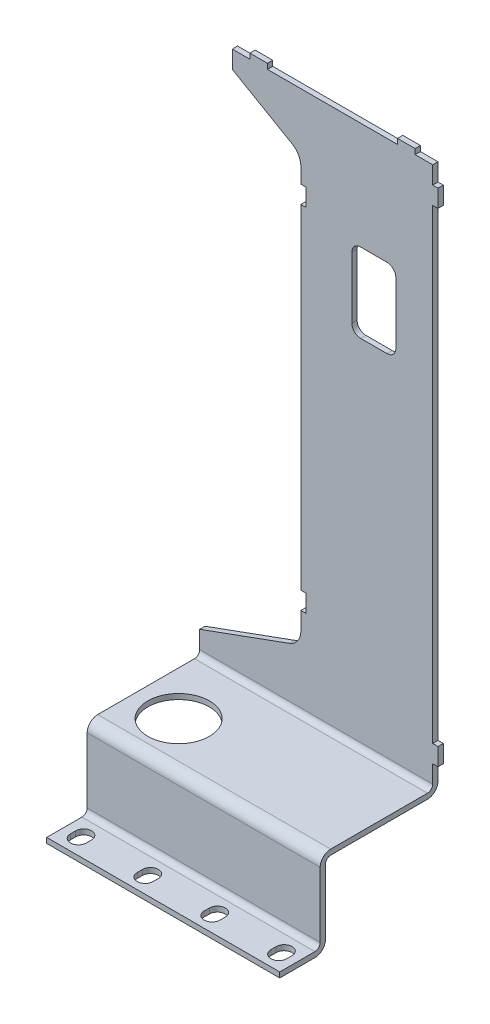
ISO-10303-21;
HEADER;
FILE_DESCRIPTION(('STEP AP214'),'2;1');
FILE_NAME('part.step','',(''),(''),'','','');
FILE_SCHEMA(('AUTOMOTIVE_DESIGN { 1 0 10303 214 1 1 1 1 }'));
ENDSEC;
DATA;
#1=APPLICATION_CONTEXT('core data for automotive mechanical design processes');
#2=APPLICATION_PROTOCOL_DEFINITION('international standard','automotive_design',2000,#1);
#3=PRODUCT_CONTEXT('',#1,'mechanical');
#4=PRODUCT('Part','Part','',(#3));
#5=PRODUCT_RELATED_PRODUCT_CATEGORY('part','',(#4));
#6=PRODUCT_DEFINITION_FORMATION('','',#4);
#7=PRODUCT_DEFINITION_CONTEXT('part definition',#1,'design');
#8=PRODUCT_DEFINITION('design','',#6,#7);
#9=PRODUCT_DEFINITION_SHAPE('','',#8);
#10=(LENGTH_UNIT() NAMED_UNIT(*) SI_UNIT(.MILLI.,.METRE.));
#11=(NAMED_UNIT(*) PLANE_ANGLE_UNIT() SI_UNIT($,.RADIAN.));
#12=(NAMED_UNIT(*) SI_UNIT($,.STERADIAN.) SOLID_ANGLE_UNIT());
#13=UNCERTAINTY_MEASURE_WITH_UNIT(LENGTH_MEASURE(1.E-05),#10,'distance_accuracy_value','');
#14=(GEOMETRIC_REPRESENTATION_CONTEXT(3) GLOBAL_UNCERTAINTY_ASSIGNED_CONTEXT((#13)) GLOBAL_UNIT_ASSIGNED_CONTEXT((#10,
#11,#12)) REPRESENTATION_CONTEXT('',''));
#15=CARTESIAN_POINT('',(0.,0.,0.));
#16=DIRECTION('',(0.,0.,1.));
#17=DIRECTION('',(1.,0.,0.));
#18=AXIS2_PLACEMENT_3D('',#15,#16,#17);
#19=CARTESIAN_POINT('',(57.5,357.,-64.));
#20=DIRECTION('',(1.,0.,0.));
#21=DIRECTION('',(0.,1.,0.));
#22=AXIS2_PLACEMENT_3D('',#19,#20,#21);
#23=PLANE('',#22);
#24=DIRECTION('',(0.,1.,0.));
#25=VECTOR('',#24,1.);
#26=CARTESIAN_POINT('',(57.5,357.,-64.));
#27=LINE('',#26,#25);
#28=CARTESIAN_POINT('',(57.5,110.,-64.));
#29=VERTEX_POINT('',#28);
#30=CARTESIAN_POINT('',(57.5,300.,-64.));
#31=VERTEX_POINT('',#30);
#32=EDGE_CURVE('E520',#29,#31,#27,.T.);
#33=ORIENTED_EDGE('',*,*,#32,.F.);
#34=DIRECTION('',(0.,0.,-1.));
#35=VECTOR('',#34,1.);
#36=CARTESIAN_POINT('',(57.5,110.,26.));
#37=LINE('',#36,#35);
#38=CARTESIAN_POINT('',(57.5,110.,-61.));
#39=VERTEX_POINT('',#38);
#40=EDGE_CURVE('E512',#39,#29,#37,.T.);
#41=ORIENTED_EDGE('',*,*,#40,.F.);
#42=DIRECTION('',(0.,1.,0.));
#43=VECTOR('',#42,1.);
#44=CARTESIAN_POINT('',(57.5,357.,-61.));
#45=LINE('',#44,#43);
#46=CARTESIAN_POINT('',(57.5,300.,-61.));
#47=VERTEX_POINT('',#46);
#48=EDGE_CURVE('E532',#39,#47,#45,.T.);
#49=ORIENTED_EDGE('',*,*,#48,.T.);
#50=DIRECTION('',(0.,0.,-1.));
#51=VECTOR('',#50,1.);
#52=CARTESIAN_POINT('',(57.5,300.,-64.));
#53=LINE('',#52,#51);
#54=EDGE_CURVE('E747',#47,#31,#53,.T.);
#55=ORIENTED_EDGE('',*,*,#54,.T.);
#56=EDGE_LOOP('',(#33,#41,#49,#55));
#57=FACE_BOUND('',#56,.T.);
#58=ADVANCED_FACE('F53',(#57),#23,.F.);
#59=CARTESIAN_POINT('',(57.5,89.9303638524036,-61.));
#60=VERTEX_POINT('',#59);
#61=CARTESIAN_POINT('',(57.5,100.,-61.));
#62=VERTEX_POINT('',#61);
#63=EDGE_CURVE('E511',#60,#62,#45,.T.);
#64=ORIENTED_EDGE('',*,*,#63,.T.);
#65=DIRECTION('',(0.,0.,-1.));
#66=VECTOR('',#65,1.);
#67=CARTESIAN_POINT('',(57.5,100.,26.));
#68=LINE('',#67,#66);
#69=CARTESIAN_POINT('',(57.5,100.,-64.));
#70=VERTEX_POINT('',#69);
#71=EDGE_CURVE('E493',#62,#70,#68,.T.);
#72=ORIENTED_EDGE('',*,*,#71,.T.);
#73=CARTESIAN_POINT('',(57.5,89.9303638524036,-64.));
#74=VERTEX_POINT('',#73);
#75=EDGE_CURVE('E508',#74,#70,#27,.T.);
#76=ORIENTED_EDGE('',*,*,#75,.F.);
#77=DIRECTION('',(0.,0.,1.));
#78=VECTOR('',#77,1.);
#79=CARTESIAN_POINT('',(57.5,89.9303638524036,-61.));
#80=LINE('',#79,#78);
#81=EDGE_CURVE('E1678',#74,#60,#80,.T.);
#82=ORIENTED_EDGE('',*,*,#81,.T.);
#83=EDGE_LOOP('',(#64,#72,#76,#82));
#84=FACE_BOUND('',#83,.T.);
#85=ADVANCED_FACE('F506',(#84),#23,.F.);
#86=CARTESIAN_POINT('',(-317.516928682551,357.,-64.));
#87=DIRECTION('',(0.,1.,0.));
#88=DIRECTION('',(0.,0.,1.));
#89=AXIS2_PLACEMENT_3D('',#86,#87,#88);
#90=PLANE('',#89);
#91=DIRECTION('',(0.,0.,1.));
#92=VECTOR('',#91,1.);
#93=CARTESIAN_POINT('',(122.5,357.,-74.4403065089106));
#94=LINE('',#93,#92);
#95=CARTESIAN_POINT('',(122.5,357.,-64.));
#96=VERTEX_POINT('',#95);
#97=CARTESIAN_POINT('',(122.5,357.,-61.));
#98=VERTEX_POINT('',#97);
#99=EDGE_CURVE('E635',#96,#98,#94,.T.);
#100=ORIENTED_EDGE('',*,*,#99,.T.);
#101=DIRECTION('',(1.,0.,0.));
#102=VECTOR('',#101,1.);
#103=CARTESIAN_POINT('',(-317.516928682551,357.,-61.));
#104=LINE('',#103,#102);
#105=CARTESIAN_POINT('',(132.5,357.,-61.));
#106=VERTEX_POINT('',#105);
#107=EDGE_CURVE('E851',#98,#106,#104,.T.);
#108=ORIENTED_EDGE('',*,*,#107,.T.);
#109=DIRECTION('',(0.,0.,1.));
#110=VECTOR('',#109,1.);
#111=CARTESIAN_POINT('',(132.5,357.,-64.));
#112=LINE('',#111,#110);
#113=CARTESIAN_POINT('',(132.5,357.,-64.));
#114=VERTEX_POINT('',#113);
#115=EDGE_CURVE('E873',#114,#106,#112,.T.);
#116=ORIENTED_EDGE('',*,*,#115,.F.);
#117=DIRECTION('',(1.,0.,0.));
#118=VECTOR('',#117,1.);
#119=CARTESIAN_POINT('',(-317.516928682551,357.,-64.));
#120=LINE('',#119,#118);
#121=EDGE_CURVE('E854',#96,#114,#120,.T.);
#122=ORIENTED_EDGE('',*,*,#121,.F.);
#123=EDGE_LOOP('',(#100,#108,#116,#122));
#124=FACE_BOUND('',#123,.T.);
#125=ADVANCED_FACE('F796',(#124),#90,.T.);
#126=DIRECTION('',(0.,0.,1.));
#127=VECTOR('',#126,1.);
#128=CARTESIAN_POINT('',(112.5,357.,-74.4403065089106));
#129=LINE('',#128,#127);
#130=CARTESIAN_POINT('',(112.5,357.,-64.));
#131=VERTEX_POINT('',#130);
#132=CARTESIAN_POINT('',(112.5,357.,-61.));
#133=VERTEX_POINT('',#132);
#134=EDGE_CURVE('E628',#131,#133,#129,.T.);
#135=ORIENTED_EDGE('',*,*,#134,.F.);
#136=CARTESIAN_POINT('',(38.5,357.,-64.));
#137=VERTEX_POINT('',#136);
#138=EDGE_CURVE('E852',#137,#131,#120,.T.);
#139=ORIENTED_EDGE('',*,*,#138,.F.);
#140=DIRECTION('',(0.,0.,1.));
#141=VECTOR('',#140,1.);
#142=CARTESIAN_POINT('',(38.5,357.,-74.4403065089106));
#143=LINE('',#142,#141);
#144=CARTESIAN_POINT('',(38.5,357.,-61.));
#145=VERTEX_POINT('',#144);
#146=EDGE_CURVE('E609',#137,#145,#143,.T.);
#147=ORIENTED_EDGE('',*,*,#146,.T.);
#148=EDGE_CURVE('E855',#145,#133,#104,.T.);
#149=ORIENTED_EDGE('',*,*,#148,.T.);
#150=EDGE_LOOP('',(#135,#139,#147,#149));
#151=FACE_BOUND('',#150,.T.);
#152=ADVANCED_FACE('F1472',(#151),#90,.T.);
#153=CARTESIAN_POINT('',(132.5,0.,3.));
#154=DIRECTION('',(-1.,0.,0.));
#155=DIRECTION('',(0.,0.,1.));
#156=AXIS2_PLACEMENT_3D('',#153,#154,#155);
#157=PLANE('',#156);
#158=DIRECTION('',(0.,1.,0.));
#159=VECTOR('',#158,1.);
#160=CARTESIAN_POINT('',(132.5,46.,-64.));
#161=LINE('',#160,#159);
#162=CARTESIAN_POINT('',(132.5,52.,-64.));
#163=VERTEX_POINT('',#162);
#164=CARTESIAN_POINT('',(132.5,61.9999999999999,-64.));
#165=VERTEX_POINT('',#164);
#166=EDGE_CURVE('E878',#163,#165,#161,.T.);
#167=ORIENTED_EDGE('',*,*,#166,.T.);
#168=DIRECTION('',(0.,0.,1.));
#169=VECTOR('',#168,1.);
#170=CARTESIAN_POINT('',(132.5,61.9999999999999,-74.4403065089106));
#171=LINE('',#170,#169);
#172=CARTESIAN_POINT('',(132.5,61.9999999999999,-61.));
#173=VERTEX_POINT('',#172);
#174=EDGE_CURVE('E575',#165,#173,#171,.T.);
#175=ORIENTED_EDGE('',*,*,#174,.T.);
#176=DIRECTION('',(0.,-1.,0.));
#177=VECTOR('',#176,1.);
#178=CARTESIAN_POINT('',(132.5,49.,-61.));
#179=LINE('',#178,#177);
#180=CARTESIAN_POINT('',(132.5,52.,-61.));
#181=VERTEX_POINT('',#180);
#182=EDGE_CURVE('E867',#173,#181,#179,.T.);
#183=ORIENTED_EDGE('',*,*,#182,.T.);
#184=CARTESIAN_POINT('',(132.5,52.,-58.));
#185=DIRECTION('',(-1.,0.,0.));
#186=DIRECTION('',(0.,0.,1.));
#187=AXIS2_PLACEMENT_3D('',#184,#185,#186);
#188=CIRCLE('',#187,3.);
#189=CARTESIAN_POINT('',(132.5,49.,-58.));
#190=VERTEX_POINT('',#189);
#191=EDGE_CURVE('E1651',#181,#190,#188,.T.);
#192=ORIENTED_EDGE('',*,*,#191,.T.);
#193=DIRECTION('',(0.,0.,-1.));
#194=VECTOR('',#193,1.);
#195=CARTESIAN_POINT('',(132.5,49.,3.));
#196=LINE('',#195,#194);
#197=CARTESIAN_POINT('',(132.5,49.,-3.));
#198=VERTEX_POINT('',#197);
#199=EDGE_CURVE('E1774',#198,#190,#196,.T.);
#200=ORIENTED_EDGE('',*,*,#199,.F.);
#201=CARTESIAN_POINT('',(132.5,43.,-3.));
#202=DIRECTION('',(-1.,0.,0.));
#203=DIRECTION('',(0.,0.,1.));
#204=AXIS2_PLACEMENT_3D('',#201,#202,#203);
#205=CIRCLE('',#204,6.);
#206=CARTESIAN_POINT('',(132.5,43.,3.));
#207=VERTEX_POINT('',#206);
#208=EDGE_CURVE('E1662',#198,#207,#205,.F.);
#209=ORIENTED_EDGE('',*,*,#208,.T.);
#210=DIRECTION('',(0.,1.,0.));
#211=VECTOR('',#210,1.);
#212=CARTESIAN_POINT('',(132.5,0.,3.));
#213=LINE('',#212,#211);
#214=CARTESIAN_POINT('',(132.5,6.,3.));
#215=VERTEX_POINT('',#214);
#216=EDGE_CURVE('E1760',#215,#207,#213,.T.);
#217=ORIENTED_EDGE('',*,*,#216,.F.);
#218=CARTESIAN_POINT('',(132.5,6.,6.));
#219=DIRECTION('',(-1.,0.,0.));
#220=DIRECTION('',(0.,0.,1.));
#221=AXIS2_PLACEMENT_3D('',#218,#219,#220);
#222=CIRCLE('',#221,3.);
#223=CARTESIAN_POINT('',(132.5,3.,6.));
#224=VERTEX_POINT('',#223);
#225=EDGE_CURVE('E1787',#215,#224,#222,.T.);
#226=ORIENTED_EDGE('',*,*,#225,.T.);
#227=DIRECTION('',(0.,0.,1.));
#228=VECTOR('',#227,1.);
#229=CARTESIAN_POINT('',(132.5,3.,3.));
#230=LINE('',#229,#228);
#231=CARTESIAN_POINT('',(132.5,3.,26.));
#232=VERTEX_POINT('',#231);
#233=EDGE_CURVE('E1747',#224,#232,#230,.T.);
#234=ORIENTED_EDGE('',*,*,#233,.T.);
#235=DIRECTION('',(0.,-1.,0.));
#236=VECTOR('',#235,1.);
#237=CARTESIAN_POINT('',(132.5,0.,26.));
#238=LINE('',#237,#236);
#239=CARTESIAN_POINT('',(132.5,0.,26.));
#240=VERTEX_POINT('',#239);
#241=EDGE_CURVE('E1744',#232,#240,#238,.T.);
#242=ORIENTED_EDGE('',*,*,#241,.T.);
#243=DIRECTION('',(0.,0.,-1.));
#244=VECTOR('',#243,1.);
#245=CARTESIAN_POINT('',(132.5,0.,3.));
#246=LINE('',#245,#244);
#247=CARTESIAN_POINT('',(132.5,0.,6.));
#248=VERTEX_POINT('',#247);
#249=EDGE_CURVE('E1776',#240,#248,#246,.T.);
#250=ORIENTED_EDGE('',*,*,#249,.T.);
#251=CARTESIAN_POINT('',(132.5,6.00000000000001,6.));
#252=DIRECTION('',(-1.,0.,0.));
#253=DIRECTION('',(0.,0.,1.));
#254=AXIS2_PLACEMENT_3D('',#251,#252,#253);
#255=CIRCLE('',#254,6.);
#256=CARTESIAN_POINT('',(132.5,6.00000000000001,0.));
#257=VERTEX_POINT('',#256);
#258=EDGE_CURVE('E1792',#248,#257,#255,.F.);
#259=ORIENTED_EDGE('',*,*,#258,.T.);
#260=DIRECTION('',(0.,1.,0.));
#261=VECTOR('',#260,1.);
#262=CARTESIAN_POINT('',(132.5,0.,0.));
#263=LINE('',#262,#261);
#264=CARTESIAN_POINT('',(132.5,43.,0.));
#265=VERTEX_POINT('',#264);
#266=EDGE_CURVE('E1750',#257,#265,#263,.T.);
#267=ORIENTED_EDGE('',*,*,#266,.T.);
#268=CARTESIAN_POINT('',(132.5,43.,-3.));
#269=DIRECTION('',(-1.,0.,0.));
#270=DIRECTION('',(0.,0.,1.));
#271=AXIS2_PLACEMENT_3D('',#268,#269,#270);
#272=CIRCLE('',#271,3.);
#273=CARTESIAN_POINT('',(132.5,46.,-3.));
#274=VERTEX_POINT('',#273);
#275=EDGE_CURVE('E1655',#265,#274,#272,.T.);
#276=ORIENTED_EDGE('',*,*,#275,.T.);
#277=DIRECTION('',(0.,0.,-1.));
#278=VECTOR('',#277,1.);
#279=CARTESIAN_POINT('',(132.5,46.,0.));
#280=LINE('',#279,#278);
#281=CARTESIAN_POINT('',(132.5,46.,-58.));
#282=VERTEX_POINT('',#281);
#283=EDGE_CURVE('E884',#274,#282,#280,.T.);
#284=ORIENTED_EDGE('',*,*,#283,.T.);
#285=CARTESIAN_POINT('',(132.5,52.,-58.));
#286=DIRECTION('',(-1.,0.,0.));
#287=DIRECTION('',(0.,0.,1.));
#288=AXIS2_PLACEMENT_3D('',#285,#286,#287);
#289=CIRCLE('',#288,6.);
#290=EDGE_CURVE('E1664',#282,#163,#289,.F.);
#291=ORIENTED_EDGE('',*,*,#290,.T.);
#292=EDGE_LOOP('',(#167,#175,#183,#192,#200,#209,#217,#226,#234,#242,#250,#259,#267,#276,#284,#291));
#293=FACE_BOUND('',#292,.T.);
#294=ADVANCED_FACE('F1343',(#293),#157,.F.);
#295=DIRECTION('',(0.,0.,1.));
#296=VECTOR('',#295,1.);
#297=CARTESIAN_POINT('',(132.5,347.,-74.4403065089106));
#298=LINE('',#297,#296);
#299=CARTESIAN_POINT('',(132.5,347.,-64.));
#300=VERTEX_POINT('',#299);
#301=CARTESIAN_POINT('',(132.5,347.,-61.));
#302=VERTEX_POINT('',#301);
#303=EDGE_CURVE('E556',#300,#302,#298,.T.);
#304=ORIENTED_EDGE('',*,*,#303,.F.);
#305=EDGE_CURVE('E882',#300,#114,#161,.T.);
#306=ORIENTED_EDGE('',*,*,#305,.T.);
#307=ORIENTED_EDGE('',*,*,#115,.T.);
#308=EDGE_CURVE('E859',#106,#302,#179,.T.);
#309=ORIENTED_EDGE('',*,*,#308,.T.);
#310=EDGE_LOOP('',(#304,#306,#307,#309));
#311=FACE_BOUND('',#310,.T.);
#312=ADVANCED_FACE('F1344',(#311),#157,.F.);
#313=CARTESIAN_POINT('',(128.,49.,14.5));
#314=DIRECTION('',(1.,0.,0.));
#315=DIRECTION('',(0.,1.,0.));
#316=AXIS2_PLACEMENT_3D('',#313,#314,#315);
#317=PLANE('',#316);
#318=DIRECTION('',(0.,0.,-1.));
#319=VECTOR('',#318,1.);
#320=CARTESIAN_POINT('',(128.,3.,3.));
#321=LINE('',#320,#319);
#322=CARTESIAN_POINT('',(128.,3.,17.5));
#323=VERTEX_POINT('',#322);
#324=CARTESIAN_POINT('',(128.,3.,14.5));
#325=VERTEX_POINT('',#324);
#326=EDGE_CURVE('E1844',#323,#325,#321,.T.);
#327=ORIENTED_EDGE('',*,*,#326,.T.);
#328=DIRECTION('',(0.,-1.,0.));
#329=VECTOR('',#328,1.);
#330=CARTESIAN_POINT('',(128.,49.,14.5));
#331=LINE('',#330,#329);
#332=CARTESIAN_POINT('',(128.,0.,14.5));
#333=VERTEX_POINT('',#332);
#334=EDGE_CURVE('E1867',#325,#333,#331,.T.);
#335=ORIENTED_EDGE('',*,*,#334,.T.);
#336=DIRECTION('',(0.,0.,1.));
#337=VECTOR('',#336,1.);
#338=CARTESIAN_POINT('',(128.,0.,14.5));
#339=LINE('',#338,#337);
#340=CARTESIAN_POINT('',(128.,0.,17.5));
#341=VERTEX_POINT('',#340);
#342=EDGE_CURVE('E1861',#333,#341,#339,.T.);
#343=ORIENTED_EDGE('',*,*,#342,.T.);
#344=DIRECTION('',(0.,-1.,0.));
#345=VECTOR('',#344,1.);
#346=CARTESIAN_POINT('',(128.,49.,17.5));
#347=LINE('',#346,#345);
#348=EDGE_CURVE('E1636',#323,#341,#347,.T.);
#349=ORIENTED_EDGE('',*,*,#348,.F.);
#350=EDGE_LOOP('',(#327,#335,#343,#349));
#351=FACE_BOUND('',#350,.T.);
#352=ADVANCED_FACE('F1451',(#351),#317,.F.);
#353=CARTESIAN_POINT('',(123.5,49.,17.5));
#354=DIRECTION('',(0.,-1.,0.));
#355=DIRECTION('',(1.,0.,0.));
#356=AXIS2_PLACEMENT_3D('',#353,#354,#355);
#357=CYLINDRICAL_SURFACE('',#356,4.5);
#358=CARTESIAN_POINT('',(123.5,3.,17.5));
#359=DIRECTION('',(0.,1.,0.));
#360=DIRECTION('',(0.,0.,1.));
#361=AXIS2_PLACEMENT_3D('',#358,#359,#360);
#362=CIRCLE('',#361,4.5);
#363=CARTESIAN_POINT('',(119.,3.,17.5));
#364=VERTEX_POINT('',#363);
#365=EDGE_CURVE('E1847',#364,#323,#362,.T.);
#366=ORIENTED_EDGE('',*,*,#365,.T.);
#367=ORIENTED_EDGE('',*,*,#348,.T.);
#368=CARTESIAN_POINT('',(123.5,0.,17.5));
#369=DIRECTION('',(0.,-1.,0.));
#370=DIRECTION('',(1.,0.,0.));
#371=AXIS2_PLACEMENT_3D('',#368,#369,#370);
#372=CIRCLE('',#371,4.5);
#373=CARTESIAN_POINT('',(119.,0.,17.5));
#374=VERTEX_POINT('',#373);
#375=EDGE_CURVE('E1858',#341,#374,#372,.T.);
#376=ORIENTED_EDGE('',*,*,#375,.T.);
#377=DIRECTION('',(0.,-1.,0.));
#378=VECTOR('',#377,1.);
#379=CARTESIAN_POINT('',(119.,49.,17.5));
#380=LINE('',#379,#378);
#381=EDGE_CURVE('E1642',#364,#374,#380,.T.);
#382=ORIENTED_EDGE('',*,*,#381,.F.);
#383=EDGE_LOOP('',(#366,#367,#376,#382));
#384=FACE_BOUND('',#383,.T.);
#385=ADVANCED_FACE('F1442',(#384),#357,.F.);
#386=CARTESIAN_POINT('',(119.,49.,14.5));
#387=DIRECTION('',(-1.,0.,0.));
#388=DIRECTION('',(0.,0.,1.));
#389=AXIS2_PLACEMENT_3D('',#386,#387,#388);
#390=PLANE('',#389);
#391=DIRECTION('',(0.,0.,1.));
#392=VECTOR('',#391,1.);
#393=CARTESIAN_POINT('',(119.,3.,2.99999999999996));
#394=LINE('',#393,#392);
#395=CARTESIAN_POINT('',(119.,3.,14.5));
#396=VERTEX_POINT('',#395);
#397=EDGE_CURVE('E1850',#396,#364,#394,.T.);
#398=ORIENTED_EDGE('',*,*,#397,.T.);
#399=ORIENTED_EDGE('',*,*,#381,.T.);
#400=DIRECTION('',(0.,0.,-1.));
#401=VECTOR('',#400,1.);
#402=CARTESIAN_POINT('',(119.,0.,14.5));
#403=LINE('',#402,#401);
#404=CARTESIAN_POINT('',(119.,0.,14.5));
#405=VERTEX_POINT('',#404);
#406=EDGE_CURVE('E1855',#374,#405,#403,.T.);
#407=ORIENTED_EDGE('',*,*,#406,.T.);
#408=DIRECTION('',(0.,-1.,0.));
#409=VECTOR('',#408,1.);
#410=CARTESIAN_POINT('',(119.,49.,14.5));
#411=LINE('',#410,#409);
#412=EDGE_CURVE('E1864',#396,#405,#411,.T.);
#413=ORIENTED_EDGE('',*,*,#412,.F.);
#414=EDGE_LOOP('',(#398,#399,#407,#413));
#415=FACE_BOUND('',#414,.T.);
#416=ADVANCED_FACE('F1432',(#415),#390,.F.);
#417=CARTESIAN_POINT('',(123.5,49.,14.5));
#418=DIRECTION('',(0.,-1.,0.));
#419=DIRECTION('',(1.,0.,0.));
#420=AXIS2_PLACEMENT_3D('',#417,#418,#419);
#421=CYLINDRICAL_SURFACE('',#420,4.5);
#422=CARTESIAN_POINT('',(123.5,3.,14.5));
#423=DIRECTION('',(0.,1.,0.));
#424=DIRECTION('',(0.,0.,1.));
#425=AXIS2_PLACEMENT_3D('',#422,#423,#424);
#426=CIRCLE('',#425,4.5);
#427=EDGE_CURVE('E1842',#325,#396,#426,.T.);
#428=ORIENTED_EDGE('',*,*,#427,.T.);
#429=ORIENTED_EDGE('',*,*,#412,.T.);
#430=CARTESIAN_POINT('',(123.5,0.,14.5));
#431=DIRECTION('',(0.,-1.,0.));
#432=DIRECTION('',(1.,0.,0.));
#433=AXIS2_PLACEMENT_3D('',#430,#431,#432);
#434=CIRCLE('',#433,4.5);
#435=EDGE_CURVE('E1853',#405,#333,#434,.T.);
#436=ORIENTED_EDGE('',*,*,#435,.T.);
#437=ORIENTED_EDGE('',*,*,#334,.F.);
#438=EDGE_LOOP('',(#428,#429,#436,#437));
#439=FACE_BOUND('',#438,.T.);
#440=ADVANCED_FACE('F1422',(#439),#421,.F.);
#441=CARTESIAN_POINT('',(90.,49.,14.5));
#442=DIRECTION('',(1.,0.,0.));
#443=DIRECTION('',(0.,1.,0.));
#444=AXIS2_PLACEMENT_3D('',#441,#442,#443);
#445=PLANE('',#444);
#446=DIRECTION('',(0.,0.,-1.));
#447=VECTOR('',#446,1.);
#448=CARTESIAN_POINT('',(90.,3.,3.));
#449=LINE('',#448,#447);
#450=CARTESIAN_POINT('',(90.,3.,17.5));
#451=VERTEX_POINT('',#450);
#452=CARTESIAN_POINT('',(90.,3.,14.5));
#453=VERTEX_POINT('',#452);
#454=EDGE_CURVE('E1810',#451,#453,#449,.T.);
#455=ORIENTED_EDGE('',*,*,#454,.T.);
#456=DIRECTION('',(0.,-1.,0.));
#457=VECTOR('',#456,1.);
#458=CARTESIAN_POINT('',(90.,49.,14.5));
#459=LINE('',#458,#457);
#460=CARTESIAN_POINT('',(90.,0.,14.5));
#461=VERTEX_POINT('',#460);
#462=EDGE_CURVE('E1833',#453,#461,#459,.T.);
#463=ORIENTED_EDGE('',*,*,#462,.T.);
#464=DIRECTION('',(0.,0.,1.));
#465=VECTOR('',#464,1.);
#466=CARTESIAN_POINT('',(90.,0.,14.5));
#467=LINE('',#466,#465);
#468=CARTESIAN_POINT('',(90.,0.,17.5));
#469=VERTEX_POINT('',#468);
#470=EDGE_CURVE('E1827',#461,#469,#467,.T.);
#471=ORIENTED_EDGE('',*,*,#470,.T.);
#472=DIRECTION('',(0.,-1.,0.));
#473=VECTOR('',#472,1.);
#474=CARTESIAN_POINT('',(90.,49.,17.5));
#475=LINE('',#474,#473);
#476=EDGE_CURVE('E1839',#451,#469,#475,.T.);
#477=ORIENTED_EDGE('',*,*,#476,.F.);
#478=EDGE_LOOP('',(#455,#463,#471,#477));
#479=FACE_BOUND('',#478,.T.);
#480=ADVANCED_FACE('F1412',(#479),#445,.F.);
#481=CARTESIAN_POINT('',(85.5,49.,17.5));
#482=DIRECTION('',(0.,-1.,0.));
#483=DIRECTION('',(1.,0.,0.));
#484=AXIS2_PLACEMENT_3D('',#481,#482,#483);
#485=CYLINDRICAL_SURFACE('',#484,4.5);
#486=CARTESIAN_POINT('',(85.5,3.,17.5));
#487=DIRECTION('',(0.,1.,0.));
#488=DIRECTION('',(0.,0.,1.));
#489=AXIS2_PLACEMENT_3D('',#486,#487,#488);
#490=CIRCLE('',#489,4.5);
#491=CARTESIAN_POINT('',(81.,3.,17.5));
#492=VERTEX_POINT('',#491);
#493=EDGE_CURVE('E1813',#492,#451,#490,.T.);
#494=ORIENTED_EDGE('',*,*,#493,.T.);
#495=ORIENTED_EDGE('',*,*,#476,.T.);
#496=CARTESIAN_POINT('',(85.5,0.,17.5));
#497=DIRECTION('',(0.,-1.,0.));
#498=DIRECTION('',(1.,0.,0.));
#499=AXIS2_PLACEMENT_3D('',#496,#497,#498);
#500=CIRCLE('',#499,4.5);
#501=CARTESIAN_POINT('',(81.,0.,17.5));
#502=VERTEX_POINT('',#501);
#503=EDGE_CURVE('E1824',#469,#502,#500,.T.);
#504=ORIENTED_EDGE('',*,*,#503,.T.);
#505=DIRECTION('',(0.,-1.,0.));
#506=VECTOR('',#505,1.);
#507=CARTESIAN_POINT('',(81.,49.,17.5));
#508=LINE('',#507,#506);
#509=EDGE_CURVE('E1836',#492,#502,#508,.T.);
#510=ORIENTED_EDGE('',*,*,#509,.F.);
#511=EDGE_LOOP('',(#494,#495,#504,#510));
#512=FACE_BOUND('',#511,.T.);
#513=ADVANCED_FACE('F1402',(#512),#485,.F.);
#514=CARTESIAN_POINT('',(81.,49.,14.5));
#515=DIRECTION('',(-1.,0.,0.));
#516=DIRECTION('',(0.,0.,1.));
#517=AXIS2_PLACEMENT_3D('',#514,#515,#516);
#518=PLANE('',#517);
#519=DIRECTION('',(0.,0.,1.));
#520=VECTOR('',#519,1.);
#521=CARTESIAN_POINT('',(81.,3.,2.99999999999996));
#522=LINE('',#521,#520);
#523=CARTESIAN_POINT('',(81.,3.,14.5));
#524=VERTEX_POINT('',#523);
#525=EDGE_CURVE('E1816',#524,#492,#522,.T.);
#526=ORIENTED_EDGE('',*,*,#525,.T.);
#527=ORIENTED_EDGE('',*,*,#509,.T.);
#528=DIRECTION('',(0.,0.,-1.));
#529=VECTOR('',#528,1.);
#530=CARTESIAN_POINT('',(81.,0.,14.5));
#531=LINE('',#530,#529);
#532=CARTESIAN_POINT('',(81.,0.,14.5));
#533=VERTEX_POINT('',#532);
#534=EDGE_CURVE('E1821',#502,#533,#531,.T.);
#535=ORIENTED_EDGE('',*,*,#534,.T.);
#536=DIRECTION('',(0.,-1.,0.));
#537=VECTOR('',#536,1.);
#538=CARTESIAN_POINT('',(81.,49.,14.5));
#539=LINE('',#538,#537);
#540=EDGE_CURVE('E1830',#524,#533,#539,.T.);
#541=ORIENTED_EDGE('',*,*,#540,.F.);
#542=EDGE_LOOP('',(#526,#527,#535,#541));
#543=FACE_BOUND('',#542,.T.);
#544=ADVANCED_FACE('F1392',(#543),#518,.F.);
#545=CARTESIAN_POINT('',(85.5,49.,14.5));
#546=DIRECTION('',(0.,-1.,0.));
#547=DIRECTION('',(1.,0.,0.));
#548=AXIS2_PLACEMENT_3D('',#545,#546,#547);
#549=CYLINDRICAL_SURFACE('',#548,4.5);
#550=CARTESIAN_POINT('',(85.5,3.,14.5));
#551=DIRECTION('',(0.,1.,0.));
#552=DIRECTION('',(0.,0.,1.));
#553=AXIS2_PLACEMENT_3D('',#550,#551,#552);
#554=CIRCLE('',#553,4.5);
#555=EDGE_CURVE('E1808',#453,#524,#554,.T.);
#556=ORIENTED_EDGE('',*,*,#555,.T.);
#557=ORIENTED_EDGE('',*,*,#540,.T.);
#558=CARTESIAN_POINT('',(85.5,0.,14.5));
#559=DIRECTION('',(0.,-1.,0.));
#560=DIRECTION('',(1.,0.,0.));
#561=AXIS2_PLACEMENT_3D('',#558,#559,#560);
#562=CIRCLE('',#561,4.5);
#563=EDGE_CURVE('E1819',#533,#461,#562,.T.);
#564=ORIENTED_EDGE('',*,*,#563,.T.);
#565=ORIENTED_EDGE('',*,*,#462,.F.);
#566=EDGE_LOOP('',(#556,#557,#564,#565));
#567=FACE_BOUND('',#566,.T.);
#568=ADVANCED_FACE('F1374',(#567),#549,.F.);
#569=CARTESIAN_POINT('',(0.,0.,3.));
#570=DIRECTION('',(0.,0.,-1.));
#571=DIRECTION('',(-1.,0.,0.));
#572=AXIS2_PLACEMENT_3D('',#569,#570,#571);
#573=PLANE('',#572);
#574=ORIENTED_EDGE('',*,*,#216,.T.);
#575=DIRECTION('',(-1.,0.,0.));
#576=VECTOR('',#575,1.);
#577=CARTESIAN_POINT('',(0.,43.,3.));
#578=LINE('',#577,#576);
#579=CARTESIAN_POINT('',(0.,43.,3.));
#580=VERTEX_POINT('',#579);
#581=EDGE_CURVE('E1673',#207,#580,#578,.T.);
#582=ORIENTED_EDGE('',*,*,#581,.T.);
#583=DIRECTION('',(0.,-1.,0.));
#584=VECTOR('',#583,1.);
#585=CARTESIAN_POINT('',(0.,0.,3.));
#586=LINE('',#585,#584);
#587=CARTESIAN_POINT('',(0.,6.,3.));
#588=VERTEX_POINT('',#587);
#589=EDGE_CURVE('E1763',#580,#588,#586,.T.);
#590=ORIENTED_EDGE('',*,*,#589,.T.);
#591=DIRECTION('',(-1.,0.,0.));
#592=VECTOR('',#591,1.);
#593=CARTESIAN_POINT('',(0.,6.,3.));
#594=LINE('',#593,#592);
#595=EDGE_CURVE('E1782',#588,#215,#594,.F.);
#596=ORIENTED_EDGE('',*,*,#595,.T.);
#597=EDGE_LOOP('',(#574,#582,#590,#596));
#598=FACE_BOUND('',#597,.T.);
#599=ADVANCED_FACE('F1370',(#598),#573,.F.);
#600=CARTESIAN_POINT('',(132.5,0.,3.));
#601=DIRECTION('',(0.,1.,0.));
#602=DIRECTION('',(-1.,0.,0.));
#603=AXIS2_PLACEMENT_3D('',#600,#601,#602);
#604=PLANE('',#603);
#605=DIRECTION('',(0.,0.,1.));
#606=VECTOR('',#605,1.);
#607=CARTESIAN_POINT('',(52.,0.,14.5));
#608=LINE('',#607,#606);
#609=CARTESIAN_POINT('',(52.,0.,14.5));
#610=VERTEX_POINT('',#609);
#611=CARTESIAN_POINT('',(52.,0.,17.5));
#612=VERTEX_POINT('',#611);
#613=EDGE_CURVE('E1693',#610,#612,#608,.T.);
#614=ORIENTED_EDGE('',*,*,#613,.F.);
#615=CARTESIAN_POINT('',(47.5,0.,14.5));
#616=DIRECTION('',(0.,-1.,0.));
#617=DIRECTION('',(1.,0.,0.));
#618=AXIS2_PLACEMENT_3D('',#615,#616,#617);
#619=CIRCLE('',#618,4.5);
#620=CARTESIAN_POINT('',(43.,0.,14.5));
#621=VERTEX_POINT('',#620);
#622=EDGE_CURVE('E1721',#621,#610,#619,.T.);
#623=ORIENTED_EDGE('',*,*,#622,.F.);
#624=DIRECTION('',(0.,0.,-1.));
#625=VECTOR('',#624,1.);
#626=CARTESIAN_POINT('',(43.,0.,14.5));
#627=LINE('',#626,#625);
#628=CARTESIAN_POINT('',(43.,0.,17.5));
#629=VERTEX_POINT('',#628);
#630=EDGE_CURVE('E1713',#629,#621,#627,.T.);
#631=ORIENTED_EDGE('',*,*,#630,.F.);
#632=CARTESIAN_POINT('',(47.5,0.,17.5));
#633=DIRECTION('',(0.,-1.,0.));
#634=DIRECTION('',(1.,0.,0.));
#635=AXIS2_PLACEMENT_3D('',#632,#633,#634);
#636=CIRCLE('',#635,4.5);
#637=EDGE_CURVE('E1705',#612,#629,#636,.T.);
#638=ORIENTED_EDGE('',*,*,#637,.F.);
#639=EDGE_LOOP('',(#614,#623,#631,#638));
#640=FACE_BOUND('',#639,.T.);
#641=DIRECTION('',(0.,0.,1.));
#642=VECTOR('',#641,1.);
#643=CARTESIAN_POINT('',(14.,0.,14.5));
#644=LINE('',#643,#642);
#645=CARTESIAN_POINT('',(14.,0.,14.5));
#646=VERTEX_POINT('',#645);
#647=CARTESIAN_POINT('',(14.,0.,17.5));
#648=VERTEX_POINT('',#647);
#649=EDGE_CURVE('E1725',#646,#648,#644,.T.);
#650=ORIENTED_EDGE('',*,*,#649,.F.);
#651=CARTESIAN_POINT('',(9.49999999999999,0.,14.5));
#652=DIRECTION('',(0.,-1.,0.));
#653=DIRECTION('',(1.,0.,0.));
#654=AXIS2_PLACEMENT_3D('',#651,#652,#653);
#655=CIRCLE('',#654,4.5);
#656=CARTESIAN_POINT('',(4.99999999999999,0.,14.5));
#657=VERTEX_POINT('',#656);
#658=EDGE_CURVE('E1723',#657,#646,#655,.T.);
#659=ORIENTED_EDGE('',*,*,#658,.F.);
#660=DIRECTION('',(0.,0.,-1.));
#661=VECTOR('',#660,1.);
#662=CARTESIAN_POINT('',(4.99999999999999,0.,14.5));
#663=LINE('',#662,#661);
#664=CARTESIAN_POINT('',(4.99999999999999,0.,17.5));
#665=VERTEX_POINT('',#664);
#666=EDGE_CURVE('E1731',#665,#657,#663,.T.);
#667=ORIENTED_EDGE('',*,*,#666,.F.);
#668=CARTESIAN_POINT('',(9.49999999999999,0.,17.5));
#669=DIRECTION('',(0.,-1.,0.));
#670=DIRECTION('',(1.,0.,0.));
#671=AXIS2_PLACEMENT_3D('',#668,#669,#670);
#672=CIRCLE('',#671,4.5);
#673=EDGE_CURVE('E1728',#648,#665,#672,.T.);
#674=ORIENTED_EDGE('',*,*,#673,.F.);
#675=EDGE_LOOP('',(#650,#659,#667,#674));
#676=FACE_BOUND('',#675,.T.);
#677=DIRECTION('',(0.,0.,-1.));
#678=VECTOR('',#677,1.);
#679=CARTESIAN_POINT('',(0.,0.,3.));
#680=LINE('',#679,#678);
#681=CARTESIAN_POINT('',(0.,0.,26.));
#682=VERTEX_POINT('',#681);
#683=CARTESIAN_POINT('',(0.,0.,6.));
#684=VERTEX_POINT('',#683);
#685=EDGE_CURVE('E1766',#682,#684,#680,.T.);
#686=ORIENTED_EDGE('',*,*,#685,.T.);
#687=DIRECTION('',(1.,0.,0.));
#688=VECTOR('',#687,1.);
#689=CARTESIAN_POINT('',(132.5,0.,6.));
#690=LINE('',#689,#688);
#691=EDGE_CURVE('E1789',#684,#248,#690,.T.);
#692=ORIENTED_EDGE('',*,*,#691,.T.);
#693=ORIENTED_EDGE('',*,*,#249,.F.);
#694=DIRECTION('',(-1.,0.,0.));
#695=VECTOR('',#694,1.);
#696=CARTESIAN_POINT('',(155.694827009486,0.,26.));
#697=LINE('',#696,#695);
#698=EDGE_CURVE('E1756',#240,#682,#697,.T.);
#699=ORIENTED_EDGE('',*,*,#698,.T.);
#700=EDGE_LOOP('',(#686,#692,#693,#699));
#701=FACE_BOUND('',#700,.T.);
#702=ORIENTED_EDGE('',*,*,#563,.F.);
#703=ORIENTED_EDGE('',*,*,#534,.F.);
#704=ORIENTED_EDGE('',*,*,#503,.F.);
#705=ORIENTED_EDGE('',*,*,#470,.F.);
#706=EDGE_LOOP('',(#702,#703,#704,#705));
#707=FACE_BOUND('',#706,.T.);
#708=ORIENTED_EDGE('',*,*,#435,.F.);
#709=ORIENTED_EDGE('',*,*,#406,.F.);
#710=ORIENTED_EDGE('',*,*,#375,.F.);
#711=ORIENTED_EDGE('',*,*,#342,.F.);
#712=EDGE_LOOP('',(#708,#709,#710,#711));
#713=FACE_BOUND('',#712,.T.);
#714=ADVANCED_FACE('F1340',(#640,#676,#701,#707,#713),#604,.F.);
#715=CARTESIAN_POINT('',(132.5,337.,-61.));
#716=VERTEX_POINT('',#715);
#717=CARTESIAN_POINT('',(132.5,72.,-61.));
#718=VERTEX_POINT('',#717);
#719=EDGE_CURVE('E865',#716,#718,#179,.T.);
#720=ORIENTED_EDGE('',*,*,#719,.T.);
#721=DIRECTION('',(0.,0.,1.));
#722=VECTOR('',#721,1.);
#723=CARTESIAN_POINT('',(132.5,72.,-74.4403065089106));
#724=LINE('',#723,#722);
#725=CARTESIAN_POINT('',(132.5,72.,-64.));
#726=VERTEX_POINT('',#725);
#727=EDGE_CURVE('E581',#726,#718,#724,.T.);
#728=ORIENTED_EDGE('',*,*,#727,.F.);
#729=CARTESIAN_POINT('',(132.5,337.,-64.));
#730=VERTEX_POINT('',#729);
#731=EDGE_CURVE('E880',#726,#730,#161,.T.);
#732=ORIENTED_EDGE('',*,*,#731,.T.);
#733=DIRECTION('',(0.,0.,1.));
#734=VECTOR('',#733,1.);
#735=CARTESIAN_POINT('',(132.5,337.,-74.4403065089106));
#736=LINE('',#735,#734);
#737=EDGE_CURVE('E551',#730,#716,#736,.T.);
#738=ORIENTED_EDGE('',*,*,#737,.T.);
#739=EDGE_LOOP('',(#720,#728,#732,#738));
#740=FACE_BOUND('',#739,.T.);
#741=ADVANCED_FACE('F1336',(#740),#157,.F.);
#742=CARTESIAN_POINT('',(0.,49.,3.));
#743=DIRECTION('',(0.,-1.,0.));
#744=DIRECTION('',(0.,0.,-1.));
#745=AXIS2_PLACEMENT_3D('',#742,#743,#744);
#746=PLANE('',#745);
#747=CARTESIAN_POINT('',(25.,49.,-24.));
#748=DIRECTION('',(0.,1.,0.));
#749=DIRECTION('',(0.,0.,1.));
#750=AXIS2_PLACEMENT_3D('',#747,#748,#749);
#751=CIRCLE('',#750,17.5);
#752=CARTESIAN_POINT('',(25.,49.,-6.50000000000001));
#753=VERTEX_POINT('',#752);
#754=EDGE_CURVE('E523',#753,#753,#751,.T.);
#755=ORIENTED_EDGE('',*,*,#754,.F.);
#756=EDGE_LOOP('',(#755));
#757=FACE_BOUND('',#756,.T.);
#758=DIRECTION('',(0.,0.,-1.));
#759=VECTOR('',#758,1.);
#760=CARTESIAN_POINT('',(0.,49.,3.));
#761=LINE('',#760,#759);
#762=CARTESIAN_POINT('',(0.,49.,-3.));
#763=VERTEX_POINT('',#762);
#764=CARTESIAN_POINT('',(0.,49.,-58.));
#765=VERTEX_POINT('',#764);
#766=EDGE_CURVE('E1772',#763,#765,#761,.T.);
#767=ORIENTED_EDGE('',*,*,#766,.F.);
#768=DIRECTION('',(-1.,0.,0.));
#769=VECTOR('',#768,1.);
#770=CARTESIAN_POINT('',(0.,49.,-3.));
#771=LINE('',#770,#769);
#772=EDGE_CURVE('E1676',#763,#198,#771,.F.);
#773=ORIENTED_EDGE('',*,*,#772,.T.);
#774=ORIENTED_EDGE('',*,*,#199,.T.);
#775=DIRECTION('',(1.,0.,0.));
#776=VECTOR('',#775,1.);
#777=CARTESIAN_POINT('',(0.,49.,-58.));
#778=LINE('',#777,#776);
#779=EDGE_CURVE('E1635',#190,#765,#778,.F.);
#780=ORIENTED_EDGE('',*,*,#779,.T.);
#781=EDGE_LOOP('',(#767,#773,#774,#780));
#782=FACE_BOUND('',#781,.T.);
#783=ADVANCED_FACE('F1217',(#757,#782),#746,.F.);
#784=CARTESIAN_POINT('',(0.,0.,3.));
#785=DIRECTION('',(1.,0.,0.));
#786=DIRECTION('',(0.,0.,-1.));
#787=AXIS2_PLACEMENT_3D('',#784,#785,#786);
#788=PLANE('',#787);
#789=DIRECTION('',(0.,1.,0.));
#790=VECTOR('',#789,1.);
#791=CARTESIAN_POINT('',(0.,49.,-61.));
#792=LINE('',#791,#790);
#793=CARTESIAN_POINT('',(0.,52.,-61.));
#794=VERTEX_POINT('',#793);
#795=CARTESIAN_POINT('',(0.,62.,-61.));
#796=VERTEX_POINT('',#795);
#797=EDGE_CURVE('E888',#794,#796,#792,.T.);
#798=ORIENTED_EDGE('',*,*,#797,.T.);
#799=DIRECTION('',(0.,0.,1.));
#800=VECTOR('',#799,1.);
#801=CARTESIAN_POINT('',(0.,62.,-64.));
#802=LINE('',#801,#800);
#803=CARTESIAN_POINT('',(0.,62.,-64.));
#804=VERTEX_POINT('',#803);
#805=EDGE_CURVE('E519',#804,#796,#802,.T.);
#806=ORIENTED_EDGE('',*,*,#805,.F.);
#807=DIRECTION('',(0.,-1.,0.));
#808=VECTOR('',#807,1.);
#809=CARTESIAN_POINT('',(0.,46.,-64.));
#810=LINE('',#809,#808);
#811=CARTESIAN_POINT('',(0.,52.,-64.));
#812=VERTEX_POINT('',#811);
#813=EDGE_CURVE('E892',#804,#812,#810,.T.);
#814=ORIENTED_EDGE('',*,*,#813,.T.);
#815=CARTESIAN_POINT('',(0.,52.,-58.));
#816=DIRECTION('',(1.,0.,0.));
#817=DIRECTION('',(0.,0.,-1.));
#818=AXIS2_PLACEMENT_3D('',#815,#816,#817);
#819=CIRCLE('',#818,6.);
#820=CARTESIAN_POINT('',(0.,46.,-58.));
#821=VERTEX_POINT('',#820);
#822=EDGE_CURVE('E1671',#812,#821,#819,.F.);
#823=ORIENTED_EDGE('',*,*,#822,.T.);
#824=DIRECTION('',(0.,0.,1.));
#825=VECTOR('',#824,1.);
#826=CARTESIAN_POINT('',(0.,46.,0.));
#827=LINE('',#826,#825);
#828=CARTESIAN_POINT('',(0.,46.,-3.));
#829=VERTEX_POINT('',#828);
#830=EDGE_CURVE('E891',#821,#829,#827,.T.);
#831=ORIENTED_EDGE('',*,*,#830,.T.);
#832=CARTESIAN_POINT('',(0.,43.,-3.));
#833=DIRECTION('',(1.,0.,0.));
#834=DIRECTION('',(0.,0.,-1.));
#835=AXIS2_PLACEMENT_3D('',#832,#833,#834);
#836=CIRCLE('',#835,3.);
#837=CARTESIAN_POINT('',(0.,43.,0.));
#838=VERTEX_POINT('',#837);
#839=EDGE_CURVE('E1657',#829,#838,#836,.T.);
#840=ORIENTED_EDGE('',*,*,#839,.T.);
#841=DIRECTION('',(0.,-1.,0.));
#842=VECTOR('',#841,1.);
#843=CARTESIAN_POINT('',(0.,0.,0.));
#844=LINE('',#843,#842);
#845=CARTESIAN_POINT('',(0.,6.,0.));
#846=VERTEX_POINT('',#845);
#847=EDGE_CURVE('E1764',#838,#846,#844,.T.);
#848=ORIENTED_EDGE('',*,*,#847,.T.);
#849=CARTESIAN_POINT('',(0.,6.,6.));
#850=DIRECTION('',(1.,0.,0.));
#851=DIRECTION('',(0.,0.,-1.));
#852=AXIS2_PLACEMENT_3D('',#849,#850,#851);
#853=CIRCLE('',#852,6.);
#854=EDGE_CURVE('E1797',#846,#684,#853,.F.);
#855=ORIENTED_EDGE('',*,*,#854,.T.);
#856=ORIENTED_EDGE('',*,*,#685,.F.);
#857=DIRECTION('',(0.,1.,0.));
#858=VECTOR('',#857,1.);
#859=CARTESIAN_POINT('',(0.,0.,26.));
#860=LINE('',#859,#858);
#861=CARTESIAN_POINT('',(0.,3.,26.));
#862=VERTEX_POINT('',#861);
#863=EDGE_CURVE('E1737',#682,#862,#860,.T.);
#864=ORIENTED_EDGE('',*,*,#863,.T.);
#865=DIRECTION('',(0.,0.,-1.));
#866=VECTOR('',#865,1.);
#867=CARTESIAN_POINT('',(0.,3.,3.));
#868=LINE('',#867,#866);
#869=CARTESIAN_POINT('',(0.,3.,6.));
#870=VERTEX_POINT('',#869);
#871=EDGE_CURVE('E1753',#862,#870,#868,.T.);
#872=ORIENTED_EDGE('',*,*,#871,.T.);
#873=CARTESIAN_POINT('',(0.,6.,6.));
#874=DIRECTION('',(1.,0.,0.));
#875=DIRECTION('',(0.,0.,-1.));
#876=AXIS2_PLACEMENT_3D('',#873,#874,#875);
#877=CIRCLE('',#876,3.);
#878=EDGE_CURVE('E1784',#870,#588,#877,.T.);
#879=ORIENTED_EDGE('',*,*,#878,.T.);
#880=ORIENTED_EDGE('',*,*,#589,.F.);
#881=CARTESIAN_POINT('',(0.,43.,-3.));
#882=DIRECTION('',(1.,0.,0.));
#883=DIRECTION('',(0.,0.,-1.));
#884=AXIS2_PLACEMENT_3D('',#881,#882,#883);
#885=CIRCLE('',#884,6.);
#886=EDGE_CURVE('E1669',#580,#763,#885,.F.);
#887=ORIENTED_EDGE('',*,*,#886,.T.);
#888=ORIENTED_EDGE('',*,*,#766,.T.);
#889=CARTESIAN_POINT('',(0.,52.,-58.));
#890=DIRECTION('',(1.,0.,0.));
#891=DIRECTION('',(0.,0.,-1.));
#892=AXIS2_PLACEMENT_3D('',#889,#890,#891);
#893=CIRCLE('',#892,3.);
#894=EDGE_CURVE('E1653',#765,#794,#893,.T.);
#895=ORIENTED_EDGE('',*,*,#894,.T.);
#896=EDGE_LOOP('',(#798,#806,#814,#823,#831,#840,#848,#855,#856,#864,#872,#879,#880,#887,#888,#895));
#897=FACE_BOUND('',#896,.T.);
#898=ADVANCED_FACE('F1212',(#897),#788,.F.);
#899=CARTESIAN_POINT('',(0.,0.,0.));
#900=DIRECTION('',(0.,0.,-1.));
#901=DIRECTION('',(-1.,0.,0.));
#902=AXIS2_PLACEMENT_3D('',#899,#900,#901);
#903=PLANE('',#902);
#904=ORIENTED_EDGE('',*,*,#847,.F.);
#905=DIRECTION('',(1.,0.,0.));
#906=VECTOR('',#905,1.);
#907=CARTESIAN_POINT('',(132.5,43.,0.));
#908=LINE('',#907,#906);
#909=EDGE_CURVE('E1639',#838,#265,#908,.T.);
#910=ORIENTED_EDGE('',*,*,#909,.T.);
#911=ORIENTED_EDGE('',*,*,#266,.F.);
#912=DIRECTION('',(1.,0.,0.));
#913=VECTOR('',#912,1.);
#914=CARTESIAN_POINT('',(0.,6.,0.));
#915=LINE('',#914,#913);
#916=EDGE_CURVE('E1794',#257,#846,#915,.F.);
#917=ORIENTED_EDGE('',*,*,#916,.T.);
#918=EDGE_LOOP('',(#904,#910,#911,#917));
#919=FACE_BOUND('',#918,.T.);
#920=ADVANCED_FACE('F1216',(#919),#903,.T.);
#921=CARTESIAN_POINT('',(155.694827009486,3.,3.));
#922=DIRECTION('',(0.,1.,0.));
#923=DIRECTION('',(0.,0.,1.));
#924=AXIS2_PLACEMENT_3D('',#921,#922,#923);
#925=PLANE('',#924);
#926=CARTESIAN_POINT('',(47.5,3.,14.5));
#927=DIRECTION('',(0.,1.,0.));
#928=DIRECTION('',(0.,0.,1.));
#929=AXIS2_PLACEMENT_3D('',#926,#927,#928);
#930=CIRCLE('',#929,4.5);
#931=CARTESIAN_POINT('',(52.,3.,14.5));
#932=VERTEX_POINT('',#931);
#933=CARTESIAN_POINT('',(43.,3.,14.5));
#934=VERTEX_POINT('',#933);
#935=EDGE_CURVE('E1718',#932,#934,#930,.T.);
#936=ORIENTED_EDGE('',*,*,#935,.F.);
#937=DIRECTION('',(0.,0.,-1.));
#938=VECTOR('',#937,1.);
#939=CARTESIAN_POINT('',(52.,3.,3.));
#940=LINE('',#939,#938);
#941=CARTESIAN_POINT('',(52.,3.,17.5));
#942=VERTEX_POINT('',#941);
#943=EDGE_CURVE('E1692',#942,#932,#940,.T.);
#944=ORIENTED_EDGE('',*,*,#943,.F.);
#945=CARTESIAN_POINT('',(47.5,3.,17.5));
#946=DIRECTION('',(0.,1.,0.));
#947=DIRECTION('',(0.,0.,1.));
#948=AXIS2_PLACEMENT_3D('',#945,#946,#947);
#949=CIRCLE('',#948,4.5);
#950=CARTESIAN_POINT('',(43.,3.,17.5));
#951=VERTEX_POINT('',#950);
#952=EDGE_CURVE('E1703',#951,#942,#949,.T.);
#953=ORIENTED_EDGE('',*,*,#952,.F.);
#954=DIRECTION('',(0.,0.,1.));
#955=VECTOR('',#954,1.);
#956=CARTESIAN_POINT('',(43.,3.,2.99999999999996));
#957=LINE('',#956,#955);
#958=EDGE_CURVE('E1710',#934,#951,#957,.T.);
#959=ORIENTED_EDGE('',*,*,#958,.F.);
#960=EDGE_LOOP('',(#936,#944,#953,#959));
#961=FACE_BOUND('',#960,.T.);
#962=CARTESIAN_POINT('',(9.49999999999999,3.,14.5));
#963=DIRECTION('',(0.,1.,0.));
#964=DIRECTION('',(0.,0.,1.));
#965=AXIS2_PLACEMENT_3D('',#962,#963,#964);
#966=CIRCLE('',#965,4.5);
#967=CARTESIAN_POINT('',(14.,3.,14.5));
#968=VERTEX_POINT('',#967);
#969=CARTESIAN_POINT('',(4.99999999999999,3.,14.5));
#970=VERTEX_POINT('',#969);
#971=EDGE_CURVE('E1806',#968,#970,#966,.T.);
#972=ORIENTED_EDGE('',*,*,#971,.F.);
#973=DIRECTION('',(0.,0.,-1.));
#974=VECTOR('',#973,1.);
#975=CARTESIAN_POINT('',(14.,3.,3.));
#976=LINE('',#975,#974);
#977=CARTESIAN_POINT('',(14.,3.,17.5));
#978=VERTEX_POINT('',#977);
#979=EDGE_CURVE('E1799',#978,#968,#976,.T.);
#980=ORIENTED_EDGE('',*,*,#979,.F.);
#981=CARTESIAN_POINT('',(9.49999999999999,3.,17.5));
#982=DIRECTION('',(0.,1.,0.));
#983=DIRECTION('',(0.,0.,1.));
#984=AXIS2_PLACEMENT_3D('',#981,#982,#983);
#985=CIRCLE('',#984,4.5);
#986=CARTESIAN_POINT('',(4.99999999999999,3.,17.5));
#987=VERTEX_POINT('',#986);
#988=EDGE_CURVE('E1801',#987,#978,#985,.T.);
#989=ORIENTED_EDGE('',*,*,#988,.F.);
#990=DIRECTION('',(0.,0.,1.));
#991=VECTOR('',#990,1.);
#992=CARTESIAN_POINT('',(4.99999999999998,3.,2.99999999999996));
#993=LINE('',#992,#991);
#994=EDGE_CURVE('E1804',#970,#987,#993,.T.);
#995=ORIENTED_EDGE('',*,*,#994,.F.);
#996=EDGE_LOOP('',(#972,#980,#989,#995));
#997=FACE_BOUND('',#996,.T.);
#998=ORIENTED_EDGE('',*,*,#233,.F.);
#999=DIRECTION('',(-1.,0.,0.));
#1000=VECTOR('',#999,1.);
#1001=CARTESIAN_POINT('',(155.694827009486,3.,6.));
#1002=LINE('',#1001,#1000);
#1003=EDGE_CURVE('E1779',#224,#870,#1002,.T.);
#1004=ORIENTED_EDGE('',*,*,#1003,.T.);
#1005=ORIENTED_EDGE('',*,*,#871,.F.);
#1006=DIRECTION('',(-1.,0.,0.));
#1007=VECTOR('',#1006,1.);
#1008=CARTESIAN_POINT('',(155.694827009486,3.,26.));
#1009=LINE('',#1008,#1007);
#1010=EDGE_CURVE('E1748',#232,#862,#1009,.T.);
#1011=ORIENTED_EDGE('',*,*,#1010,.F.);
#1012=EDGE_LOOP('',(#998,#1004,#1005,#1011));
#1013=FACE_BOUND('',#1012,.T.);
#1014=ORIENTED_EDGE('',*,*,#555,.F.);
#1015=ORIENTED_EDGE('',*,*,#454,.F.);
#1016=ORIENTED_EDGE('',*,*,#493,.F.);
#1017=ORIENTED_EDGE('',*,*,#525,.F.);
#1018=EDGE_LOOP('',(#1014,#1015,#1016,#1017));
#1019=FACE_BOUND('',#1018,.T.);
#1020=ORIENTED_EDGE('',*,*,#427,.F.);
#1021=ORIENTED_EDGE('',*,*,#326,.F.);
#1022=ORIENTED_EDGE('',*,*,#365,.F.);
#1023=ORIENTED_EDGE('',*,*,#397,.F.);
#1024=EDGE_LOOP('',(#1020,#1021,#1022,#1023));
#1025=FACE_BOUND('',#1024,.T.);
#1026=ADVANCED_FACE('F1232',(#961,#997,#1013,#1019,#1025),#925,.T.);
#1027=CARTESIAN_POINT('',(155.694827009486,0.,26.));
#1028=DIRECTION('',(0.,0.,1.));
#1029=DIRECTION('',(1.,0.,0.));
#1030=AXIS2_PLACEMENT_3D('',#1027,#1028,#1029);
#1031=PLANE('',#1030);
#1032=ORIENTED_EDGE('',*,*,#241,.F.);
#1033=ORIENTED_EDGE('',*,*,#1010,.T.);
#1034=ORIENTED_EDGE('',*,*,#863,.F.);
#1035=ORIENTED_EDGE('',*,*,#698,.F.);
#1036=EDGE_LOOP('',(#1032,#1033,#1034,#1035));
#1037=FACE_BOUND('',#1036,.T.);
#1038=ADVANCED_FACE('F1241',(#1037),#1031,.T.);
#1039=CARTESIAN_POINT('',(155.694827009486,6.,6.));
#1040=DIRECTION('',(-1.,0.,0.));
#1041=DIRECTION('',(0.,0.,1.));
#1042=AXIS2_PLACEMENT_3D('',#1039,#1040,#1041);
#1043=CYLINDRICAL_SURFACE('',#1042,3.);
#1044=ORIENTED_EDGE('',*,*,#225,.F.);
#1045=ORIENTED_EDGE('',*,*,#595,.F.);
#1046=ORIENTED_EDGE('',*,*,#878,.F.);
#1047=ORIENTED_EDGE('',*,*,#1003,.F.);
#1048=EDGE_LOOP('',(#1044,#1045,#1046,#1047));
#1049=FACE_BOUND('',#1048,.T.);
#1050=ADVANCED_FACE('F1251',(#1049),#1043,.F.);
#1051=CARTESIAN_POINT('',(132.5,6.00000000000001,6.));
#1052=DIRECTION('',(-1.,0.,0.));
#1053=DIRECTION('',(0.,-1.,0.));
#1054=AXIS2_PLACEMENT_3D('',#1051,#1052,#1053);
#1055=CYLINDRICAL_SURFACE('',#1054,6.);
#1056=ORIENTED_EDGE('',*,*,#854,.F.);
#1057=ORIENTED_EDGE('',*,*,#916,.F.);
#1058=ORIENTED_EDGE('',*,*,#258,.F.);
#1059=ORIENTED_EDGE('',*,*,#691,.F.);
#1060=EDGE_LOOP('',(#1056,#1057,#1058,#1059));
#1061=FACE_BOUND('',#1060,.T.);
#1062=ADVANCED_FACE('F1259',(#1061),#1055,.T.);
#1063=CARTESIAN_POINT('',(9.49999999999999,49.,14.5));
#1064=DIRECTION('',(0.,-1.,0.));
#1065=DIRECTION('',(1.,0.,0.));
#1066=AXIS2_PLACEMENT_3D('',#1063,#1064,#1065);
#1067=CYLINDRICAL_SURFACE('',#1066,4.5);
#1068=ORIENTED_EDGE('',*,*,#971,.T.);
#1069=DIRECTION('',(0.,-1.,0.));
#1070=VECTOR('',#1069,1.);
#1071=CARTESIAN_POINT('',(4.99999999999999,49.,14.5));
#1072=LINE('',#1071,#1070);
#1073=EDGE_CURVE('E1735',#970,#657,#1072,.T.);
#1074=ORIENTED_EDGE('',*,*,#1073,.T.);
#1075=ORIENTED_EDGE('',*,*,#658,.T.);
#1076=DIRECTION('',(0.,-1.,0.));
#1077=VECTOR('',#1076,1.);
#1078=CARTESIAN_POINT('',(14.,49.,14.5));
#1079=LINE('',#1078,#1077);
#1080=EDGE_CURVE('E1734',#968,#646,#1079,.T.);
#1081=ORIENTED_EDGE('',*,*,#1080,.F.);
#1082=EDGE_LOOP('',(#1068,#1074,#1075,#1081));
#1083=FACE_BOUND('',#1082,.T.);
#1084=ADVANCED_FACE('F1267',(#1083),#1067,.F.);
#1085=CARTESIAN_POINT('',(4.99999999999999,49.,14.5));
#1086=DIRECTION('',(-1.,0.,0.));
#1087=DIRECTION('',(0.,0.,1.));
#1088=AXIS2_PLACEMENT_3D('',#1085,#1086,#1087);
#1089=PLANE('',#1088);
#1090=ORIENTED_EDGE('',*,*,#994,.T.);
#1091=DIRECTION('',(0.,-1.,0.));
#1092=VECTOR('',#1091,1.);
#1093=CARTESIAN_POINT('',(4.99999999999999,49.,17.5));
#1094=LINE('',#1093,#1092);
#1095=EDGE_CURVE('E1738',#987,#665,#1094,.T.);
#1096=ORIENTED_EDGE('',*,*,#1095,.T.);
#1097=ORIENTED_EDGE('',*,*,#666,.T.);
#1098=ORIENTED_EDGE('',*,*,#1073,.F.);
#1099=EDGE_LOOP('',(#1090,#1096,#1097,#1098));
#1100=FACE_BOUND('',#1099,.T.);
#1101=ADVANCED_FACE('F1275',(#1100),#1089,.F.);
#1102=CARTESIAN_POINT('',(9.49999999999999,49.,17.5));
#1103=DIRECTION('',(0.,-1.,0.));
#1104=DIRECTION('',(1.,0.,0.));
#1105=AXIS2_PLACEMENT_3D('',#1102,#1103,#1104);
#1106=CYLINDRICAL_SURFACE('',#1105,4.5);
#1107=ORIENTED_EDGE('',*,*,#988,.T.);
#1108=DIRECTION('',(0.,-1.,0.));
#1109=VECTOR('',#1108,1.);
#1110=CARTESIAN_POINT('',(14.,49.,17.5));
#1111=LINE('',#1110,#1109);
#1112=EDGE_CURVE('E1740',#978,#648,#1111,.T.);
#1113=ORIENTED_EDGE('',*,*,#1112,.T.);
#1114=ORIENTED_EDGE('',*,*,#673,.T.);
#1115=ORIENTED_EDGE('',*,*,#1095,.F.);
#1116=EDGE_LOOP('',(#1107,#1113,#1114,#1115));
#1117=FACE_BOUND('',#1116,.T.);
#1118=ADVANCED_FACE('F1283',(#1117),#1106,.F.);
#1119=CARTESIAN_POINT('',(14.,49.,14.5));
#1120=DIRECTION('',(1.,0.,0.));
#1121=DIRECTION('',(0.,1.,0.));
#1122=AXIS2_PLACEMENT_3D('',#1119,#1120,#1121);
#1123=PLANE('',#1122);
#1124=ORIENTED_EDGE('',*,*,#979,.T.);
#1125=ORIENTED_EDGE('',*,*,#1080,.T.);
#1126=ORIENTED_EDGE('',*,*,#649,.T.);
#1127=ORIENTED_EDGE('',*,*,#1112,.F.);
#1128=EDGE_LOOP('',(#1124,#1125,#1126,#1127));
#1129=FACE_BOUND('',#1128,.T.);
#1130=ADVANCED_FACE('F1291',(#1129),#1123,.F.);
#1131=CARTESIAN_POINT('',(47.5,49.,14.5));
#1132=DIRECTION('',(0.,-1.,0.));
#1133=DIRECTION('',(1.,0.,0.));
#1134=AXIS2_PLACEMENT_3D('',#1131,#1132,#1133);
#1135=CYLINDRICAL_SURFACE('',#1134,4.5);
#1136=ORIENTED_EDGE('',*,*,#935,.T.);
#1137=DIRECTION('',(0.,-1.,0.));
#1138=VECTOR('',#1137,1.);
#1139=CARTESIAN_POINT('',(43.,49.,14.5));
#1140=LINE('',#1139,#1138);
#1141=EDGE_CURVE('E1715',#934,#621,#1140,.T.);
#1142=ORIENTED_EDGE('',*,*,#1141,.T.);
#1143=ORIENTED_EDGE('',*,*,#622,.T.);
#1144=DIRECTION('',(0.,-1.,0.));
#1145=VECTOR('',#1144,1.);
#1146=CARTESIAN_POINT('',(52.,49.,14.5));
#1147=LINE('',#1146,#1145);
#1148=EDGE_CURVE('E1697',#932,#610,#1147,.T.);
#1149=ORIENTED_EDGE('',*,*,#1148,.F.);
#1150=EDGE_LOOP('',(#1136,#1142,#1143,#1149));
#1151=FACE_BOUND('',#1150,.T.);
#1152=ADVANCED_FACE('F1299',(#1151),#1135,.F.);
#1153=CARTESIAN_POINT('',(43.,49.,14.5));
#1154=DIRECTION('',(-1.,0.,0.));
#1155=DIRECTION('',(0.,0.,1.));
#1156=AXIS2_PLACEMENT_3D('',#1153,#1154,#1155);
#1157=PLANE('',#1156);
#1158=ORIENTED_EDGE('',*,*,#958,.T.);
#1159=DIRECTION('',(0.,-1.,0.));
#1160=VECTOR('',#1159,1.);
#1161=CARTESIAN_POINT('',(43.,49.,17.5));
#1162=LINE('',#1161,#1160);
#1163=EDGE_CURVE('E1707',#951,#629,#1162,.T.);
#1164=ORIENTED_EDGE('',*,*,#1163,.T.);
#1165=ORIENTED_EDGE('',*,*,#630,.T.);
#1166=ORIENTED_EDGE('',*,*,#1141,.F.);
#1167=EDGE_LOOP('',(#1158,#1164,#1165,#1166));
#1168=FACE_BOUND('',#1167,.T.);
#1169=ADVANCED_FACE('F1307',(#1168),#1157,.F.);
#1170=CARTESIAN_POINT('',(47.5,49.,17.5));
#1171=DIRECTION('',(0.,-1.,0.));
#1172=DIRECTION('',(1.,0.,0.));
#1173=AXIS2_PLACEMENT_3D('',#1170,#1171,#1172);
#1174=CYLINDRICAL_SURFACE('',#1173,4.5);
#1175=ORIENTED_EDGE('',*,*,#952,.T.);
#1176=DIRECTION('',(0.,-1.,0.));
#1177=VECTOR('',#1176,1.);
#1178=CARTESIAN_POINT('',(52.,49.,17.5));
#1179=LINE('',#1178,#1177);
#1180=EDGE_CURVE('E1700',#942,#612,#1179,.T.);
#1181=ORIENTED_EDGE('',*,*,#1180,.T.);
#1182=ORIENTED_EDGE('',*,*,#637,.T.);
#1183=ORIENTED_EDGE('',*,*,#1163,.F.);
#1184=EDGE_LOOP('',(#1175,#1181,#1182,#1183));
#1185=FACE_BOUND('',#1184,.T.);
#1186=ADVANCED_FACE('F1315',(#1185),#1174,.F.);
#1187=CARTESIAN_POINT('',(52.,49.,14.5));
#1188=DIRECTION('',(1.,0.,0.));
#1189=DIRECTION('',(0.,1.,0.));
#1190=AXIS2_PLACEMENT_3D('',#1187,#1188,#1189);
#1191=PLANE('',#1190);
#1192=ORIENTED_EDGE('',*,*,#943,.T.);
#1193=ORIENTED_EDGE('',*,*,#1148,.T.);
#1194=ORIENTED_EDGE('',*,*,#613,.T.);
#1195=ORIENTED_EDGE('',*,*,#1180,.F.);
#1196=EDGE_LOOP('',(#1192,#1193,#1194,#1195));
#1197=FACE_BOUND('',#1196,.T.);
#1198=ADVANCED_FACE('F1096',(#1197),#1191,.F.);
#1199=CARTESIAN_POINT('',(-317.516928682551,49.,-61.));
#1200=DIRECTION('',(0.,0.,1.));
#1201=DIRECTION('',(1.,0.,0.));
#1202=AXIS2_PLACEMENT_3D('',#1199,#1200,#1201);
#1203=PLANE('',#1202);
#1204=DIRECTION('',(0.,1.,0.));
#1205=VECTOR('',#1204,1.);
#1206=CARTESIAN_POINT('',(111.5,49.0000000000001,-61.));
#1207=LINE('',#1206,#1205);
#1208=CARTESIAN_POINT('',(111.5,256.,-61.));
#1209=VERTEX_POINT('',#1208);
#1210=CARTESIAN_POINT('',(111.5,291.,-61.));
#1211=VERTEX_POINT('',#1210);
#1212=EDGE_CURVE('E690',#1209,#1211,#1207,.T.);
#1213=ORIENTED_EDGE('',*,*,#1212,.F.);
#1214=CARTESIAN_POINT('',(106.5,256.,-61.));
#1215=DIRECTION('',(0.,0.,1.));
#1216=DIRECTION('',(1.,0.,0.));
#1217=AXIS2_PLACEMENT_3D('',#1214,#1215,#1216);
#1218=CIRCLE('',#1217,5.);
#1219=CARTESIAN_POINT('',(106.5,251.,-61.));
#1220=VERTEX_POINT('',#1219);
#1221=EDGE_CURVE('E723',#1209,#1220,#1218,.F.);
#1222=ORIENTED_EDGE('',*,*,#1221,.T.);
#1223=DIRECTION('',(1.,0.,0.));
#1224=VECTOR('',#1223,1.);
#1225=CARTESIAN_POINT('',(-317.516928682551,251.,-61.));
#1226=LINE('',#1225,#1224);
#1227=CARTESIAN_POINT('',(91.5,251.,-61.));
#1228=VERTEX_POINT('',#1227);
#1229=EDGE_CURVE('E699',#1228,#1220,#1226,.T.);
#1230=ORIENTED_EDGE('',*,*,#1229,.F.);
#1231=CARTESIAN_POINT('',(91.5,256.,-61.));
#1232=DIRECTION('',(0.,0.,1.));
#1233=DIRECTION('',(1.,0.,0.));
#1234=AXIS2_PLACEMENT_3D('',#1231,#1232,#1233);
#1235=CIRCLE('',#1234,5.);
#1236=CARTESIAN_POINT('',(86.5,256.,-61.));
#1237=VERTEX_POINT('',#1236);
#1238=EDGE_CURVE('E737',#1228,#1237,#1235,.F.);
#1239=ORIENTED_EDGE('',*,*,#1238,.T.);
#1240=DIRECTION('',(0.,-1.,0.));
#1241=VECTOR('',#1240,1.);
#1242=CARTESIAN_POINT('',(86.4999999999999,48.9999999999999,-61.));
#1243=LINE('',#1242,#1241);
#1244=CARTESIAN_POINT('',(86.5,291.,-61.));
#1245=VERTEX_POINT('',#1244);
#1246=EDGE_CURVE('E696',#1245,#1237,#1243,.T.);
#1247=ORIENTED_EDGE('',*,*,#1246,.F.);
#1248=CARTESIAN_POINT('',(91.5,291.,-61.));
#1249=DIRECTION('',(0.,0.,1.));
#1250=DIRECTION('',(1.,0.,0.));
#1251=AXIS2_PLACEMENT_3D('',#1248,#1249,#1250);
#1252=CIRCLE('',#1251,5.);
#1253=CARTESIAN_POINT('',(91.5,296.,-61.));
#1254=VERTEX_POINT('',#1253);
#1255=EDGE_CURVE('E726',#1245,#1254,#1252,.F.);
#1256=ORIENTED_EDGE('',*,*,#1255,.T.);
#1257=DIRECTION('',(-1.,0.,0.));
#1258=VECTOR('',#1257,1.);
#1259=CARTESIAN_POINT('',(-317.516928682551,296.,-61.));
#1260=LINE('',#1259,#1258);
#1261=CARTESIAN_POINT('',(106.5,296.,-61.));
#1262=VERTEX_POINT('',#1261);
#1263=EDGE_CURVE('E693',#1262,#1254,#1260,.T.);
#1264=ORIENTED_EDGE('',*,*,#1263,.F.);
#1265=CARTESIAN_POINT('',(106.5,291.,-61.));
#1266=DIRECTION('',(0.,0.,1.));
#1267=DIRECTION('',(1.,0.,0.));
#1268=AXIS2_PLACEMENT_3D('',#1265,#1266,#1267);
#1269=CIRCLE('',#1268,5.);
#1270=EDGE_CURVE('E13',#1262,#1211,#1269,.F.);
#1271=ORIENTED_EDGE('',*,*,#1270,.T.);
#1272=EDGE_LOOP('',(#1213,#1222,#1230,#1239,#1247,#1256,#1264,#1271));
#1273=FACE_BOUND('',#1272,.T.);
#1274=DIRECTION('',(-1.,0.,0.));
#1275=VECTOR('',#1274,1.);
#1276=CARTESIAN_POINT('',(-317.516928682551,110.,-61.));
#1277=LINE('',#1276,#1275);
#1278=CARTESIAN_POINT('',(60.5,110.,-61.));
#1279=VERTEX_POINT('',#1278);
#1280=EDGE_CURVE('E679',#1279,#39,#1277,.T.);
#1281=ORIENTED_EDGE('',*,*,#1280,.F.);
#1282=DIRECTION('',(0.,1.,0.));
#1283=VECTOR('',#1282,1.);
#1284=CARTESIAN_POINT('',(60.5,49.,-61.));
#1285=LINE('',#1284,#1283);
#1286=CARTESIAN_POINT('',(60.5,100.,-61.));
#1287=VERTEX_POINT('',#1286);
#1288=EDGE_CURVE('E677',#1287,#1279,#1285,.T.);
#1289=ORIENTED_EDGE('',*,*,#1288,.F.);
#1290=DIRECTION('',(1.,0.,0.));
#1291=VECTOR('',#1290,1.);
#1292=CARTESIAN_POINT('',(-317.516928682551,100.,-61.));
#1293=LINE('',#1292,#1291);
#1294=EDGE_CURVE('E681',#62,#1287,#1293,.T.);
#1295=ORIENTED_EDGE('',*,*,#1294,.F.);
#1296=ORIENTED_EDGE('',*,*,#63,.F.);
#1297=CARTESIAN_POINT('',(47.5,89.9303638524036,-61.));
#1298=DIRECTION('',(0.,0.,1.));
#1299=DIRECTION('',(1.,0.,0.));
#1300=AXIS2_PLACEMENT_3D('',#1297,#1298,#1299);
#1301=CIRCLE('',#1300,10.);
#1302=CARTESIAN_POINT('',(50.9202014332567,80.5334376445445,-61.));
#1303=VERTEX_POINT('',#1302);
#1304=EDGE_CURVE('E825',#60,#1303,#1301,.F.);
#1305=ORIENTED_EDGE('',*,*,#1304,.T.);
#1306=DIRECTION('',(0.939692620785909,0.342020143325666,0.));
#1307=VECTOR('',#1306,1.);
#1308=CARTESIAN_POINT('',(57.5,82.9282884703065,-61.));
#1309=LINE('',#1308,#1307);
#1310=EDGE_CURVE('E544',#796,#1303,#1309,.T.);
#1311=ORIENTED_EDGE('',*,*,#1310,.F.);
#1312=ORIENTED_EDGE('',*,*,#797,.F.);
#1313=DIRECTION('',(1.,0.,0.));
#1314=VECTOR('',#1313,1.);
#1315=CARTESIAN_POINT('',(-317.516928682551,52.,-61.));
#1316=LINE('',#1315,#1314);
#1317=EDGE_CURVE('E1633',#794,#181,#1316,.T.);
#1318=ORIENTED_EDGE('',*,*,#1317,.T.);
#1319=ORIENTED_EDGE('',*,*,#182,.F.);
#1320=DIRECTION('',(1.,0.,0.));
#1321=VECTOR('',#1320,1.);
#1322=CARTESIAN_POINT('',(132.5,61.9999999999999,-61.));
#1323=LINE('',#1322,#1321);
#1324=CARTESIAN_POINT('',(135.5,61.9999999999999,-61.));
#1325=VERTEX_POINT('',#1324);
#1326=EDGE_CURVE('E598',#173,#1325,#1323,.T.);
#1327=ORIENTED_EDGE('',*,*,#1326,.T.);
#1328=DIRECTION('',(0.,1.,0.));
#1329=VECTOR('',#1328,1.);
#1330=CARTESIAN_POINT('',(135.5,72.,-61.));
#1331=LINE('',#1330,#1329);
#1332=CARTESIAN_POINT('',(135.5,72.,-61.));
#1333=VERTEX_POINT('',#1332);
#1334=EDGE_CURVE('E601',#1325,#1333,#1331,.T.);
#1335=ORIENTED_EDGE('',*,*,#1334,.T.);
#1336=DIRECTION('',(-1.,0.,0.));
#1337=VECTOR('',#1336,1.);
#1338=CARTESIAN_POINT('',(132.5,72.,-61.));
#1339=LINE('',#1338,#1337);
#1340=EDGE_CURVE('E597',#1333,#718,#1339,.T.);
#1341=ORIENTED_EDGE('',*,*,#1340,.T.);
#1342=ORIENTED_EDGE('',*,*,#719,.F.);
#1343=DIRECTION('',(1.,0.,0.));
#1344=VECTOR('',#1343,1.);
#1345=CARTESIAN_POINT('',(132.5,337.,-61.));
#1346=LINE('',#1345,#1344);
#1347=CARTESIAN_POINT('',(135.5,337.,-61.));
#1348=VERTEX_POINT('',#1347);
#1349=EDGE_CURVE('E571',#716,#1348,#1346,.T.);
#1350=ORIENTED_EDGE('',*,*,#1349,.T.);
#1351=DIRECTION('',(0.,1.,0.));
#1352=VECTOR('',#1351,1.);
#1353=CARTESIAN_POINT('',(135.5,347.,-61.));
#1354=LINE('',#1353,#1352);
#1355=CARTESIAN_POINT('',(135.5,347.,-61.));
#1356=VERTEX_POINT('',#1355);
#1357=EDGE_CURVE('E574',#1348,#1356,#1354,.T.);
#1358=ORIENTED_EDGE('',*,*,#1357,.T.);
#1359=DIRECTION('',(-1.,0.,0.));
#1360=VECTOR('',#1359,1.);
#1361=CARTESIAN_POINT('',(132.5,347.,-61.));
#1362=LINE('',#1361,#1360);
#1363=EDGE_CURVE('E570',#1356,#302,#1362,.T.);
#1364=ORIENTED_EDGE('',*,*,#1363,.T.);
#1365=ORIENTED_EDGE('',*,*,#308,.F.);
#1366=ORIENTED_EDGE('',*,*,#107,.F.);
#1367=DIRECTION('',(0.,1.,0.));
#1368=VECTOR('',#1367,1.);
#1369=CARTESIAN_POINT('',(122.5,357.,-61.));
#1370=LINE('',#1369,#1368);
#1371=CARTESIAN_POINT('',(122.5,360.,-61.));
#1372=VERTEX_POINT('',#1371);
#1373=EDGE_CURVE('E653',#98,#1372,#1370,.T.);
#1374=ORIENTED_EDGE('',*,*,#1373,.T.);
#1375=DIRECTION('',(-1.,0.,0.));
#1376=VECTOR('',#1375,1.);
#1377=CARTESIAN_POINT('',(112.5,360.,-61.));
#1378=LINE('',#1377,#1376);
#1379=CARTESIAN_POINT('',(112.5,360.,-61.));
#1380=VERTEX_POINT('',#1379);
#1381=EDGE_CURVE('E639',#1372,#1380,#1378,.T.);
#1382=ORIENTED_EDGE('',*,*,#1381,.T.);
#1383=DIRECTION('',(0.,-1.,0.));
#1384=VECTOR('',#1383,1.);
#1385=CARTESIAN_POINT('',(112.5,357.,-61.));
#1386=LINE('',#1385,#1384);
#1387=EDGE_CURVE('E650',#1380,#133,#1386,.T.);
#1388=ORIENTED_EDGE('',*,*,#1387,.T.);
#1389=ORIENTED_EDGE('',*,*,#148,.F.);
#1390=DIRECTION('',(0.,1.,0.));
#1391=VECTOR('',#1390,1.);
#1392=CARTESIAN_POINT('',(38.5,357.,-61.));
#1393=LINE('',#1392,#1391);
#1394=CARTESIAN_POINT('',(38.5,360.,-61.));
#1395=VERTEX_POINT('',#1394);
#1396=EDGE_CURVE('E627',#145,#1395,#1393,.T.);
#1397=ORIENTED_EDGE('',*,*,#1396,.T.);
#1398=DIRECTION('',(-1.,0.,0.));
#1399=VECTOR('',#1398,1.);
#1400=CARTESIAN_POINT('',(28.5,360.,-61.));
#1401=LINE('',#1400,#1399);
#1402=CARTESIAN_POINT('',(28.5,360.,-61.));
#1403=VERTEX_POINT('',#1402);
#1404=EDGE_CURVE('E613',#1395,#1403,#1401,.T.);
#1405=ORIENTED_EDGE('',*,*,#1404,.T.);
#1406=DIRECTION('',(0.,-1.,0.));
#1407=VECTOR('',#1406,1.);
#1408=CARTESIAN_POINT('',(28.5,357.,-61.));
#1409=LINE('',#1408,#1407);
#1410=CARTESIAN_POINT('',(28.5,357.,-61.));
#1411=VERTEX_POINT('',#1410);
#1412=EDGE_CURVE('E624',#1403,#1411,#1409,.T.);
#1413=ORIENTED_EDGE('',*,*,#1412,.T.);
#1414=CARTESIAN_POINT('',(18.5,357.,-61.));
#1415=VERTEX_POINT('',#1414);
#1416=EDGE_CURVE('E850',#1415,#1411,#104,.T.);
#1417=ORIENTED_EDGE('',*,*,#1416,.F.);
#1418=DIRECTION('',(0.,1.,0.));
#1419=VECTOR('',#1418,1.);
#1420=CARTESIAN_POINT('',(18.5,357.,-61.));
#1421=LINE('',#1420,#1419);
#1422=CARTESIAN_POINT('',(18.5,347.,-61.));
#1423=VERTEX_POINT('',#1422);
#1424=EDGE_CURVE('E539',#1423,#1415,#1421,.T.);
#1425=ORIENTED_EDGE('',*,*,#1424,.F.);
#1426=DIRECTION('',(-0.866025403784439,0.5,0.));
#1427=VECTOR('',#1426,1.);
#1428=CARTESIAN_POINT('',(57.5,324.483339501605,-61.));
#1429=LINE('',#1428,#1427);
#1430=CARTESIAN_POINT('',(52.5,327.370090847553,-61.));
#1431=VERTEX_POINT('',#1430);
#1432=EDGE_CURVE('E540',#1431,#1423,#1429,.T.);
#1433=ORIENTED_EDGE('',*,*,#1432,.F.);
#1434=CARTESIAN_POINT('',(47.5,318.709836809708,-61.));
#1435=DIRECTION('',(0.,0.,1.));
#1436=DIRECTION('',(1.,0.,0.));
#1437=AXIS2_PLACEMENT_3D('',#1434,#1435,#1436);
#1438=CIRCLE('',#1437,10.);
#1439=CARTESIAN_POINT('',(57.5,318.709836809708,-61.));
#1440=VERTEX_POINT('',#1439);
#1441=EDGE_CURVE('E830',#1431,#1440,#1438,.F.);
#1442=ORIENTED_EDGE('',*,*,#1441,.T.);
#1443=CARTESIAN_POINT('',(57.5,310.,-61.));
#1444=VERTEX_POINT('',#1443);
#1445=EDGE_CURVE('E534',#1444,#1440,#45,.T.);
#1446=ORIENTED_EDGE('',*,*,#1445,.F.);
#1447=DIRECTION('',(-1.,0.,0.));
#1448=VECTOR('',#1447,1.);
#1449=CARTESIAN_POINT('',(-317.516928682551,310.,-61.));
#1450=LINE('',#1449,#1448);
#1451=CARTESIAN_POINT('',(60.5,310.,-61.));
#1452=VERTEX_POINT('',#1451);
#1453=EDGE_CURVE('E662',#1452,#1444,#1450,.T.);
#1454=ORIENTED_EDGE('',*,*,#1453,.F.);
#1455=DIRECTION('',(0.,1.,0.));
#1456=VECTOR('',#1455,1.);
#1457=CARTESIAN_POINT('',(60.5000000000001,49.,-61.));
#1458=LINE('',#1457,#1456);
#1459=CARTESIAN_POINT('',(60.5,300.,-61.));
#1460=VERTEX_POINT('',#1459);
#1461=EDGE_CURVE('E654',#1460,#1452,#1458,.T.);
#1462=ORIENTED_EDGE('',*,*,#1461,.F.);
#1463=DIRECTION('',(1.,0.,0.));
#1464=VECTOR('',#1463,1.);
#1465=CARTESIAN_POINT('',(-317.516928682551,300.,-61.));
#1466=LINE('',#1465,#1464);
#1467=EDGE_CURVE('E660',#47,#1460,#1466,.T.);
#1468=ORIENTED_EDGE('',*,*,#1467,.F.);
#1469=ORIENTED_EDGE('',*,*,#48,.F.);
#1470=EDGE_LOOP('',(#1281,#1289,#1295,#1296,#1305,#1311,#1312,#1318,#1319,#1327,#1335,#1341,
#1342,#1350,#1358,#1364,#1365,#1366,#1374,#1382,#1388,#1389,#1397,#1405,#1413,#1417,#1425,#1433,
#1442,#1446,#1454,#1462,#1468,#1469));
#1471=FACE_BOUND('',#1470,.T.);
#1472=ADVANCED_FACE('F776',(#1273,#1471),#1203,.T.);
#1473=DIRECTION('',(0.,0.,1.));
#1474=VECTOR('',#1473,1.);
#1475=CARTESIAN_POINT('',(28.5,357.,-74.4403065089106));
#1476=LINE('',#1475,#1474);
#1477=CARTESIAN_POINT('',(28.5,357.,-64.));
#1478=VERTEX_POINT('',#1477);
#1479=EDGE_CURVE('E602',#1478,#1411,#1476,.T.);
#1480=ORIENTED_EDGE('',*,*,#1479,.F.);
#1481=CARTESIAN_POINT('',(18.5,357.,-64.));
#1482=VERTEX_POINT('',#1481);
#1483=EDGE_CURVE('E842',#1482,#1478,#120,.T.);
#1484=ORIENTED_EDGE('',*,*,#1483,.F.);
#1485=DIRECTION('',(0.,0.,-1.));
#1486=VECTOR('',#1485,1.);
#1487=CARTESIAN_POINT('',(18.5,357.,-10.2227097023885));
#1488=LINE('',#1487,#1486);
#1489=EDGE_CURVE('E541',#1415,#1482,#1488,.T.);
#1490=ORIENTED_EDGE('',*,*,#1489,.F.);
#1491=ORIENTED_EDGE('',*,*,#1416,.T.);
#1492=EDGE_LOOP('',(#1480,#1484,#1490,#1491));
#1493=FACE_BOUND('',#1492,.T.);
#1494=ADVANCED_FACE('F849',(#1493),#90,.T.);
#1495=CARTESIAN_POINT('',(-317.516928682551,46.,-64.));
#1496=DIRECTION('',(0.,0.,-1.));
#1497=DIRECTION('',(-1.,0.,0.));
#1498=AXIS2_PLACEMENT_3D('',#1495,#1496,#1497);
#1499=PLANE('',#1498);
#1500=DIRECTION('',(0.,-1.,0.));
#1501=VECTOR('',#1500,1.);
#1502=CARTESIAN_POINT('',(111.5,296.,-64.));
#1503=LINE('',#1502,#1501);
#1504=CARTESIAN_POINT('',(111.5,291.,-64.));
#1505=VERTEX_POINT('',#1504);
#1506=CARTESIAN_POINT('',(111.5,256.,-64.));
#1507=VERTEX_POINT('',#1506);
#1508=EDGE_CURVE('E711',#1505,#1507,#1503,.T.);
#1509=ORIENTED_EDGE('',*,*,#1508,.F.);
#1510=CARTESIAN_POINT('',(106.5,291.,-64.));
#1511=DIRECTION('',(0.,0.,-1.));
#1512=DIRECTION('',(-1.,0.,0.));
#1513=AXIS2_PLACEMENT_3D('',#1510,#1511,#1512);
#1514=CIRCLE('',#1513,5.);
#1515=CARTESIAN_POINT('',(106.5,296.,-64.));
#1516=VERTEX_POINT('',#1515);
#1517=EDGE_CURVE('E61',#1505,#1516,#1514,.F.);
#1518=ORIENTED_EDGE('',*,*,#1517,.T.);
#1519=DIRECTION('',(1.,0.,0.));
#1520=VECTOR('',#1519,1.);
#1521=CARTESIAN_POINT('',(111.5,296.,-64.));
#1522=LINE('',#1521,#1520);
#1523=CARTESIAN_POINT('',(91.5,296.,-64.));
#1524=VERTEX_POINT('',#1523);
#1525=EDGE_CURVE('E702',#1524,#1516,#1522,.T.);
#1526=ORIENTED_EDGE('',*,*,#1525,.F.);
#1527=CARTESIAN_POINT('',(91.5,291.,-64.));
#1528=DIRECTION('',(0.,0.,-1.));
#1529=DIRECTION('',(-1.,0.,0.));
#1530=AXIS2_PLACEMENT_3D('',#1527,#1528,#1529);
#1531=CIRCLE('',#1530,5.);
#1532=CARTESIAN_POINT('',(86.5,291.,-64.));
#1533=VERTEX_POINT('',#1532);
#1534=EDGE_CURVE('E724',#1524,#1533,#1531,.F.);
#1535=ORIENTED_EDGE('',*,*,#1534,.T.);
#1536=DIRECTION('',(0.,1.,0.));
#1537=VECTOR('',#1536,1.);
#1538=CARTESIAN_POINT('',(86.5,296.,-64.));
#1539=LINE('',#1538,#1537);
#1540=CARTESIAN_POINT('',(86.5,256.,-64.));
#1541=VERTEX_POINT('',#1540);
#1542=EDGE_CURVE('E705',#1541,#1533,#1539,.T.);
#1543=ORIENTED_EDGE('',*,*,#1542,.F.);
#1544=CARTESIAN_POINT('',(91.5,256.,-64.));
#1545=DIRECTION('',(0.,0.,-1.));
#1546=DIRECTION('',(-1.,0.,0.));
#1547=AXIS2_PLACEMENT_3D('',#1544,#1545,#1546);
#1548=CIRCLE('',#1547,5.);
#1549=CARTESIAN_POINT('',(91.5,251.,-64.));
#1550=VERTEX_POINT('',#1549);
#1551=EDGE_CURVE('E735',#1541,#1550,#1548,.F.);
#1552=ORIENTED_EDGE('',*,*,#1551,.T.);
#1553=DIRECTION('',(-1.,0.,0.));
#1554=VECTOR('',#1553,1.);
#1555=CARTESIAN_POINT('',(111.5,251.,-64.));
#1556=LINE('',#1555,#1554);
#1557=CARTESIAN_POINT('',(106.5,251.,-64.));
#1558=VERTEX_POINT('',#1557);
#1559=EDGE_CURVE('E708',#1558,#1550,#1556,.T.);
#1560=ORIENTED_EDGE('',*,*,#1559,.F.);
#1561=CARTESIAN_POINT('',(106.5,256.,-64.));
#1562=DIRECTION('',(0.,0.,-1.));
#1563=DIRECTION('',(-1.,0.,0.));
#1564=AXIS2_PLACEMENT_3D('',#1561,#1562,#1563);
#1565=CIRCLE('',#1564,5.);
#1566=EDGE_CURVE('E68',#1558,#1507,#1565,.F.);
#1567=ORIENTED_EDGE('',*,*,#1566,.T.);
#1568=EDGE_LOOP('',(#1509,#1518,#1526,#1535,#1543,#1552,#1560,#1567));
#1569=FACE_BOUND('',#1568,.T.);
#1570=DIRECTION('',(1.,0.,0.));
#1571=VECTOR('',#1570,1.);
#1572=CARTESIAN_POINT('',(60.5,110.,-64.));
#1573=LINE('',#1572,#1571);
#1574=CARTESIAN_POINT('',(60.5,110.,-64.));
#1575=VERTEX_POINT('',#1574);
#1576=EDGE_CURVE('E500',#29,#1575,#1573,.T.);
#1577=ORIENTED_EDGE('',*,*,#1576,.F.);
#1578=ORIENTED_EDGE('',*,*,#32,.T.);
#1579=DIRECTION('',(-1.,0.,0.));
#1580=VECTOR('',#1579,1.);
#1581=CARTESIAN_POINT('',(57.5,300.,-64.));
#1582=LINE('',#1581,#1580);
#1583=CARTESIAN_POINT('',(60.5,300.,-64.));
#1584=VERTEX_POINT('',#1583);
#1585=EDGE_CURVE('E667',#1584,#31,#1582,.T.);
#1586=ORIENTED_EDGE('',*,*,#1585,.F.);
#1587=DIRECTION('',(0.,-1.,0.));
#1588=VECTOR('',#1587,1.);
#1589=CARTESIAN_POINT('',(60.5,310.,-64.));
#1590=LINE('',#1589,#1588);
#1591=CARTESIAN_POINT('',(60.5,310.,-64.));
#1592=VERTEX_POINT('',#1591);
#1593=EDGE_CURVE('E671',#1592,#1584,#1590,.T.);
#1594=ORIENTED_EDGE('',*,*,#1593,.F.);
#1595=DIRECTION('',(1.,0.,0.));
#1596=VECTOR('',#1595,1.);
#1597=CARTESIAN_POINT('',(57.5,310.,-64.));
#1598=LINE('',#1597,#1596);
#1599=CARTESIAN_POINT('',(57.5,310.,-64.));
#1600=VERTEX_POINT('',#1599);
#1601=EDGE_CURVE('E674',#1600,#1592,#1598,.T.);
#1602=ORIENTED_EDGE('',*,*,#1601,.F.);
#1603=CARTESIAN_POINT('',(57.5,318.709836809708,-64.));
#1604=VERTEX_POINT('',#1603);
#1605=EDGE_CURVE('E522',#1600,#1604,#27,.T.);
#1606=ORIENTED_EDGE('',*,*,#1605,.T.);
#1607=CARTESIAN_POINT('',(47.5,318.709836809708,-64.));
#1608=DIRECTION('',(0.,0.,-1.));
#1609=DIRECTION('',(-1.,0.,0.));
#1610=AXIS2_PLACEMENT_3D('',#1607,#1608,#1609);
#1611=CIRCLE('',#1610,10.);
#1612=CARTESIAN_POINT('',(52.5,327.370090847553,-64.));
#1613=VERTEX_POINT('',#1612);
#1614=EDGE_CURVE('E823',#1604,#1613,#1611,.F.);
#1615=ORIENTED_EDGE('',*,*,#1614,.T.);
#1616=DIRECTION('',(-0.866025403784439,0.5,0.));
#1617=VECTOR('',#1616,1.);
#1618=CARTESIAN_POINT('',(57.5,324.483339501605,-64.));
#1619=LINE('',#1618,#1617);
#1620=CARTESIAN_POINT('',(18.5,347.,-64.));
#1621=VERTEX_POINT('',#1620);
#1622=EDGE_CURVE('E549',#1613,#1621,#1619,.T.);
#1623=ORIENTED_EDGE('',*,*,#1622,.T.);
#1624=DIRECTION('',(0.,1.,0.));
#1625=VECTOR('',#1624,1.);
#1626=CARTESIAN_POINT('',(18.5,357.,-64.));
#1627=LINE('',#1626,#1625);
#1628=EDGE_CURVE('E548',#1621,#1482,#1627,.T.);
#1629=ORIENTED_EDGE('',*,*,#1628,.T.);
#1630=ORIENTED_EDGE('',*,*,#1483,.T.);
#1631=DIRECTION('',(0.,-1.,0.));
#1632=VECTOR('',#1631,1.);
#1633=CARTESIAN_POINT('',(28.5,357.,-64.));
#1634=LINE('',#1633,#1632);
#1635=CARTESIAN_POINT('',(28.5,360.,-64.));
#1636=VERTEX_POINT('',#1635);
#1637=EDGE_CURVE('E608',#1636,#1478,#1634,.T.);
#1638=ORIENTED_EDGE('',*,*,#1637,.F.);
#1639=DIRECTION('',(-1.,0.,0.));
#1640=VECTOR('',#1639,1.);
#1641=CARTESIAN_POINT('',(28.5,360.,-64.));
#1642=LINE('',#1641,#1640);
#1643=CARTESIAN_POINT('',(38.5,360.,-64.));
#1644=VERTEX_POINT('',#1643);
#1645=EDGE_CURVE('E616',#1644,#1636,#1642,.T.);
#1646=ORIENTED_EDGE('',*,*,#1645,.F.);
#1647=DIRECTION('',(0.,1.,0.));
#1648=VECTOR('',#1647,1.);
#1649=CARTESIAN_POINT('',(38.5,357.,-64.));
#1650=LINE('',#1649,#1648);
#1651=EDGE_CURVE('E612',#137,#1644,#1650,.T.);
#1652=ORIENTED_EDGE('',*,*,#1651,.F.);
#1653=ORIENTED_EDGE('',*,*,#138,.T.);
#1654=DIRECTION('',(0.,-1.,0.));
#1655=VECTOR('',#1654,1.);
#1656=CARTESIAN_POINT('',(112.5,357.,-64.));
#1657=LINE('',#1656,#1655);
#1658=CARTESIAN_POINT('',(112.5,360.,-64.));
#1659=VERTEX_POINT('',#1658);
#1660=EDGE_CURVE('E634',#1659,#131,#1657,.T.);
#1661=ORIENTED_EDGE('',*,*,#1660,.F.);
#1662=DIRECTION('',(-1.,0.,0.));
#1663=VECTOR('',#1662,1.);
#1664=CARTESIAN_POINT('',(112.5,360.,-64.));
#1665=LINE('',#1664,#1663);
#1666=CARTESIAN_POINT('',(122.5,360.,-64.));
#1667=VERTEX_POINT('',#1666);
#1668=EDGE_CURVE('E642',#1667,#1659,#1665,.T.);
#1669=ORIENTED_EDGE('',*,*,#1668,.F.);
#1670=DIRECTION('',(0.,1.,0.));
#1671=VECTOR('',#1670,1.);
#1672=CARTESIAN_POINT('',(122.5,357.,-64.));
#1673=LINE('',#1672,#1671);
#1674=EDGE_CURVE('E638',#96,#1667,#1673,.T.);
#1675=ORIENTED_EDGE('',*,*,#1674,.F.);
#1676=ORIENTED_EDGE('',*,*,#121,.T.);
#1677=ORIENTED_EDGE('',*,*,#305,.F.);
#1678=DIRECTION('',(-1.,0.,0.));
#1679=VECTOR('',#1678,1.);
#1680=CARTESIAN_POINT('',(132.5,347.,-64.));
#1681=LINE('',#1680,#1679);
#1682=CARTESIAN_POINT('',(135.5,347.,-64.));
#1683=VERTEX_POINT('',#1682);
#1684=EDGE_CURVE('E563',#1683,#300,#1681,.T.);
#1685=ORIENTED_EDGE('',*,*,#1684,.F.);
#1686=DIRECTION('',(0.,1.,0.));
#1687=VECTOR('',#1686,1.);
#1688=CARTESIAN_POINT('',(135.5,347.,-64.));
#1689=LINE('',#1688,#1687);
#1690=CARTESIAN_POINT('',(135.5,337.,-64.));
#1691=VERTEX_POINT('',#1690);
#1692=EDGE_CURVE('E559',#1691,#1683,#1689,.T.);
#1693=ORIENTED_EDGE('',*,*,#1692,.F.);
#1694=DIRECTION('',(1.,0.,0.));
#1695=VECTOR('',#1694,1.);
#1696=CARTESIAN_POINT('',(132.5,337.,-64.));
#1697=LINE('',#1696,#1695);
#1698=EDGE_CURVE('E560',#730,#1691,#1697,.T.);
#1699=ORIENTED_EDGE('',*,*,#1698,.F.);
#1700=ORIENTED_EDGE('',*,*,#731,.F.);
#1701=DIRECTION('',(-1.,0.,0.));
#1702=VECTOR('',#1701,1.);
#1703=CARTESIAN_POINT('',(132.5,72.,-64.));
#1704=LINE('',#1703,#1702);
#1705=CARTESIAN_POINT('',(135.5,72.,-64.));
#1706=VERTEX_POINT('',#1705);
#1707=EDGE_CURVE('E588',#1706,#726,#1704,.T.);
#1708=ORIENTED_EDGE('',*,*,#1707,.F.);
#1709=DIRECTION('',(0.,1.,0.));
#1710=VECTOR('',#1709,1.);
#1711=CARTESIAN_POINT('',(135.5,72.,-64.));
#1712=LINE('',#1711,#1710);
#1713=CARTESIAN_POINT('',(135.5,61.9999999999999,-64.));
#1714=VERTEX_POINT('',#1713);
#1715=EDGE_CURVE('E584',#1714,#1706,#1712,.T.);
#1716=ORIENTED_EDGE('',*,*,#1715,.F.);
#1717=DIRECTION('',(1.,0.,0.));
#1718=VECTOR('',#1717,1.);
#1719=CARTESIAN_POINT('',(132.5,61.9999999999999,-64.));
#1720=LINE('',#1719,#1718);
#1721=EDGE_CURVE('E585',#165,#1714,#1720,.T.);
#1722=ORIENTED_EDGE('',*,*,#1721,.F.);
#1723=ORIENTED_EDGE('',*,*,#166,.F.);
#1724=DIRECTION('',(1.,0.,0.));
#1725=VECTOR('',#1724,1.);
#1726=CARTESIAN_POINT('',(-317.516928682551,52.,-64.));
#1727=LINE('',#1726,#1725);
#1728=EDGE_CURVE('E1666',#163,#812,#1727,.F.);
#1729=ORIENTED_EDGE('',*,*,#1728,.T.);
#1730=ORIENTED_EDGE('',*,*,#813,.F.);
#1731=DIRECTION('',(0.939692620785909,0.342020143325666,0.));
#1732=VECTOR('',#1731,1.);
#1733=CARTESIAN_POINT('',(57.5,82.9282884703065,-64.));
#1734=LINE('',#1733,#1732);
#1735=CARTESIAN_POINT('',(50.9202014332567,80.5334376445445,-64.));
#1736=VERTEX_POINT('',#1735);
#1737=EDGE_CURVE('E527',#804,#1736,#1734,.T.);
#1738=ORIENTED_EDGE('',*,*,#1737,.T.);
#1739=CARTESIAN_POINT('',(47.5,89.9303638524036,-64.));
#1740=DIRECTION('',(0.,0.,-1.));
#1741=DIRECTION('',(-1.,0.,0.));
#1742=AXIS2_PLACEMENT_3D('',#1739,#1740,#1741);
#1743=CIRCLE('',#1742,10.);
#1744=EDGE_CURVE('E518',#1736,#74,#1743,.F.);
#1745=ORIENTED_EDGE('',*,*,#1744,.T.);
#1746=ORIENTED_EDGE('',*,*,#75,.T.);
#1747=DIRECTION('',(-1.,0.,0.));
#1748=VECTOR('',#1747,1.);
#1749=CARTESIAN_POINT('',(60.5,100.,-64.));
#1750=LINE('',#1749,#1748);
#1751=CARTESIAN_POINT('',(60.5000000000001,100.,-64.));
#1752=VERTEX_POINT('',#1751);
#1753=EDGE_CURVE('E490',#1752,#70,#1750,.T.);
#1754=ORIENTED_EDGE('',*,*,#1753,.F.);
#1755=DIRECTION('',(0.,-1.,0.));
#1756=VECTOR('',#1755,1.);
#1757=CARTESIAN_POINT('',(60.5,110.,-64.));
#1758=LINE('',#1757,#1756);
#1759=EDGE_CURVE('E501',#1575,#1752,#1758,.T.);
#1760=ORIENTED_EDGE('',*,*,#1759,.F.);
#1761=EDGE_LOOP('',(#1577,#1578,#1586,#1594,#1602,#1606,#1615,#1623,#1629,#1630,#1638,#1646,
#1652,#1653,#1661,#1669,#1675,#1676,#1677,#1685,#1693,#1699,#1700,#1708,#1716,#1722,#1723,#1729,
#1730,#1738,#1745,#1746,#1754,#1760));
#1762=FACE_BOUND('',#1761,.T.);
#1763=ADVANCED_FACE('F515',(#1569,#1762),#1499,.T.);
#1764=CARTESIAN_POINT('',(-317.516928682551,46.,0.));
#1765=DIRECTION('',(0.,-1.,0.));
#1766=DIRECTION('',(0.,0.,-1.));
#1767=AXIS2_PLACEMENT_3D('',#1764,#1765,#1766);
#1768=PLANE('',#1767);
#1769=CARTESIAN_POINT('',(25.,46.,-24.));
#1770=DIRECTION('',(0.,-1.,0.));
#1771=DIRECTION('',(0.,0.,-1.));
#1772=AXIS2_PLACEMENT_3D('',#1769,#1770,#1771);
#1773=CIRCLE('',#1772,17.5);
#1774=CARTESIAN_POINT('',(25.,46.,-41.5));
#1775=VERTEX_POINT('',#1774);
#1776=EDGE_CURVE('E887',#1775,#1775,#1773,.T.);
#1777=ORIENTED_EDGE('',*,*,#1776,.F.);
#1778=EDGE_LOOP('',(#1777));
#1779=FACE_BOUND('',#1778,.T.);
#1780=ORIENTED_EDGE('',*,*,#830,.F.);
#1781=DIRECTION('',(1.,0.,0.));
#1782=VECTOR('',#1781,1.);
#1783=CARTESIAN_POINT('',(-317.516928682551,46.,-58.));
#1784=LINE('',#1783,#1782);
#1785=EDGE_CURVE('E1659',#821,#282,#1784,.T.);
#1786=ORIENTED_EDGE('',*,*,#1785,.T.);
#1787=ORIENTED_EDGE('',*,*,#283,.F.);
#1788=DIRECTION('',(1.,0.,0.));
#1789=VECTOR('',#1788,1.);
#1790=CARTESIAN_POINT('',(0.,46.,-3.));
#1791=LINE('',#1790,#1789);
#1792=EDGE_CURVE('E1648',#274,#829,#1791,.F.);
#1793=ORIENTED_EDGE('',*,*,#1792,.T.);
#1794=EDGE_LOOP('',(#1780,#1786,#1787,#1793));
#1795=FACE_BOUND('',#1794,.T.);
#1796=ADVANCED_FACE('F1105',(#1779,#1795),#1768,.T.);
#1797=CARTESIAN_POINT('',(-317.516928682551,52.,-58.));
#1798=DIRECTION('',(1.,0.,0.));
#1799=DIRECTION('',(0.,0.,-1.));
#1800=AXIS2_PLACEMENT_3D('',#1797,#1798,#1799);
#1801=CYLINDRICAL_SURFACE('',#1800,3.);
#1802=ORIENTED_EDGE('',*,*,#894,.F.);
#1803=ORIENTED_EDGE('',*,*,#779,.F.);
#1804=ORIENTED_EDGE('',*,*,#191,.F.);
#1805=ORIENTED_EDGE('',*,*,#1317,.F.);
#1806=EDGE_LOOP('',(#1802,#1803,#1804,#1805));
#1807=FACE_BOUND('',#1806,.T.);
#1808=ADVANCED_FACE('F1168',(#1807),#1801,.F.);
#1809=CARTESIAN_POINT('',(0.,43.,-3.));
#1810=DIRECTION('',(-1.,0.,0.));
#1811=DIRECTION('',(0.,0.,1.));
#1812=AXIS2_PLACEMENT_3D('',#1809,#1810,#1811);
#1813=CYLINDRICAL_SURFACE('',#1812,3.);
#1814=ORIENTED_EDGE('',*,*,#839,.F.);
#1815=ORIENTED_EDGE('',*,*,#1792,.F.);
#1816=ORIENTED_EDGE('',*,*,#275,.F.);
#1817=ORIENTED_EDGE('',*,*,#909,.F.);
#1818=EDGE_LOOP('',(#1814,#1815,#1816,#1817));
#1819=FACE_BOUND('',#1818,.T.);
#1820=ADVANCED_FACE('F1178',(#1819),#1813,.F.);
#1821=CARTESIAN_POINT('',(-317.516928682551,52.,-58.));
#1822=DIRECTION('',(1.,0.,0.));
#1823=DIRECTION('',(0.,0.,-1.));
#1824=AXIS2_PLACEMENT_3D('',#1821,#1822,#1823);
#1825=CYLINDRICAL_SURFACE('',#1824,6.);
#1826=ORIENTED_EDGE('',*,*,#822,.F.);
#1827=ORIENTED_EDGE('',*,*,#1728,.F.);
#1828=ORIENTED_EDGE('',*,*,#290,.F.);
#1829=ORIENTED_EDGE('',*,*,#1785,.F.);
#1830=EDGE_LOOP('',(#1826,#1827,#1828,#1829));
#1831=FACE_BOUND('',#1830,.T.);
#1832=ADVANCED_FACE('F1187',(#1831),#1825,.T.);
#1833=CARTESIAN_POINT('',(0.,43.,-3.));
#1834=DIRECTION('',(-1.,0.,0.));
#1835=DIRECTION('',(0.,0.,1.));
#1836=AXIS2_PLACEMENT_3D('',#1833,#1834,#1835);
#1837=CYLINDRICAL_SURFACE('',#1836,6.);
#1838=ORIENTED_EDGE('',*,*,#208,.F.);
#1839=ORIENTED_EDGE('',*,*,#772,.F.);
#1840=ORIENTED_EDGE('',*,*,#886,.F.);
#1841=ORIENTED_EDGE('',*,*,#581,.F.);
#1842=EDGE_LOOP('',(#1838,#1839,#1840,#1841));
#1843=FACE_BOUND('',#1842,.T.);
#1844=ADVANCED_FACE('F810',(#1843),#1837,.T.);
#1845=CARTESIAN_POINT('',(25.,0.,-24.));
#1846=DIRECTION('',(0.,1.,0.));
#1847=DIRECTION('',(0.,0.,1.));
#1848=AXIS2_PLACEMENT_3D('',#1845,#1846,#1847);
#1849=CYLINDRICAL_SURFACE('',#1848,17.5);
#1850=ORIENTED_EDGE('',*,*,#1776,.T.);
#1851=EDGE_LOOP('',(#1850));
#1852=FACE_BOUND('',#1851,.T.);
#1853=ORIENTED_EDGE('',*,*,#754,.T.);
#1854=EDGE_LOOP('',(#1853));
#1855=FACE_BOUND('',#1854,.T.);
#1856=ADVANCED_FACE('F802',(#1852,#1855),#1849,.F.);
#1857=ORIENTED_EDGE('',*,*,#1605,.F.);
#1858=DIRECTION('',(0.,0.,1.));
#1859=VECTOR('',#1858,1.);
#1860=CARTESIAN_POINT('',(57.5,310.,-64.));
#1861=LINE('',#1860,#1859);
#1862=EDGE_CURVE('E752',#1600,#1444,#1861,.T.);
#1863=ORIENTED_EDGE('',*,*,#1862,.T.);
#1864=ORIENTED_EDGE('',*,*,#1445,.T.);
#1865=DIRECTION('',(0.,0.,-1.));
#1866=VECTOR('',#1865,1.);
#1867=CARTESIAN_POINT('',(57.5,318.709836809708,-64.));
#1868=LINE('',#1867,#1866);
#1869=EDGE_CURVE('E817',#1440,#1604,#1868,.T.);
#1870=ORIENTED_EDGE('',*,*,#1869,.T.);
#1871=EDGE_LOOP('',(#1857,#1863,#1864,#1870));
#1872=FACE_BOUND('',#1871,.T.);
#1873=ADVANCED_FACE('F792',(#1872),#23,.F.);
#1874=CARTESIAN_POINT('',(57.5,82.9282884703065,-64.));
#1875=DIRECTION('',(0.342020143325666,-0.939692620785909,0.));
#1876=DIRECTION('',(0.939692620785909,0.342020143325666,0.));
#1877=AXIS2_PLACEMENT_3D('',#1874,#1875,#1876);
#1878=PLANE('',#1877);
#1879=ORIENTED_EDGE('',*,*,#1310,.T.);
#1880=DIRECTION('',(0.,0.,1.));
#1881=VECTOR('',#1880,1.);
#1882=CARTESIAN_POINT('',(50.9202014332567,80.5334376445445,-64.));
#1883=LINE('',#1882,#1881);
#1884=EDGE_CURVE('E1682',#1303,#1736,#1883,.F.);
#1885=ORIENTED_EDGE('',*,*,#1884,.T.);
#1886=ORIENTED_EDGE('',*,*,#1737,.F.);
#1887=ORIENTED_EDGE('',*,*,#805,.T.);
#1888=EDGE_LOOP('',(#1879,#1885,#1886,#1887));
#1889=FACE_BOUND('',#1888,.T.);
#1890=ADVANCED_FACE('F801',(#1889),#1878,.F.);
#1891=CARTESIAN_POINT('',(57.5,324.483339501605,-10.2227097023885));
#1892=DIRECTION('',(-0.5,-0.866025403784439,0.));
#1893=DIRECTION('',(0.866025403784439,-0.5,0.));
#1894=AXIS2_PLACEMENT_3D('',#1891,#1892,#1893);
#1895=PLANE('',#1894);
#1896=ORIENTED_EDGE('',*,*,#1622,.F.);
#1897=DIRECTION('',(0.,0.,-1.));
#1898=VECTOR('',#1897,1.);
#1899=CARTESIAN_POINT('',(52.5,327.370090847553,-10.2227097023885));
#1900=LINE('',#1899,#1898);
#1901=EDGE_CURVE('E821',#1613,#1431,#1900,.F.);
#1902=ORIENTED_EDGE('',*,*,#1901,.T.);
#1903=ORIENTED_EDGE('',*,*,#1432,.T.);
#1904=DIRECTION('',(0.,0.,-1.));
#1905=VECTOR('',#1904,1.);
#1906=CARTESIAN_POINT('',(18.5,347.,-10.2227097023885));
#1907=LINE('',#1906,#1905);
#1908=EDGE_CURVE('E536',#1423,#1621,#1907,.T.);
#1909=ORIENTED_EDGE('',*,*,#1908,.T.);
#1910=EDGE_LOOP('',(#1896,#1902,#1903,#1909));
#1911=FACE_BOUND('',#1910,.T.);
#1912=ADVANCED_FACE('F808',(#1911),#1895,.T.);
#1913=CARTESIAN_POINT('',(18.5,357.,-10.2227097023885));
#1914=DIRECTION('',(-1.,0.,0.));
#1915=DIRECTION('',(0.,-1.,0.));
#1916=AXIS2_PLACEMENT_3D('',#1913,#1914,#1915);
#1917=PLANE('',#1916);
#1918=ORIENTED_EDGE('',*,*,#1908,.F.);
#1919=ORIENTED_EDGE('',*,*,#1424,.T.);
#1920=ORIENTED_EDGE('',*,*,#1489,.T.);
#1921=ORIENTED_EDGE('',*,*,#1628,.F.);
#1922=EDGE_LOOP('',(#1918,#1919,#1920,#1921));
#1923=FACE_BOUND('',#1922,.T.);
#1924=ADVANCED_FACE('F844',(#1923),#1917,.T.);
#1925=CARTESIAN_POINT('',(132.5,337.,-74.4403065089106));
#1926=DIRECTION('',(0.,-1.,0.));
#1927=DIRECTION('',(0.,0.,-1.));
#1928=AXIS2_PLACEMENT_3D('',#1925,#1926,#1927);
#1929=PLANE('',#1928);
#1930=ORIENTED_EDGE('',*,*,#737,.F.);
#1931=ORIENTED_EDGE('',*,*,#1698,.T.);
#1932=DIRECTION('',(0.,0.,1.));
#1933=VECTOR('',#1932,1.);
#1934=CARTESIAN_POINT('',(135.5,337.,-74.4403065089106));
#1935=LINE('',#1934,#1933);
#1936=EDGE_CURVE('E557',#1691,#1348,#1935,.T.);
#1937=ORIENTED_EDGE('',*,*,#1936,.T.);
#1938=ORIENTED_EDGE('',*,*,#1349,.F.);
#1939=EDGE_LOOP('',(#1930,#1931,#1937,#1938));
#1940=FACE_BOUND('',#1939,.T.);
#1941=ADVANCED_FACE('F977',(#1940),#1929,.T.);
#1942=CARTESIAN_POINT('',(135.5,347.,-74.4403065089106));
#1943=DIRECTION('',(1.,0.,0.));
#1944=DIRECTION('',(0.,0.,-1.));
#1945=AXIS2_PLACEMENT_3D('',#1942,#1943,#1944);
#1946=PLANE('',#1945);
#1947=ORIENTED_EDGE('',*,*,#1936,.F.);
#1948=ORIENTED_EDGE('',*,*,#1692,.T.);
#1949=DIRECTION('',(0.,0.,1.));
#1950=VECTOR('',#1949,1.);
#1951=CARTESIAN_POINT('',(135.5,347.,-74.4403065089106));
#1952=LINE('',#1951,#1950);
#1953=EDGE_CURVE('E561',#1683,#1356,#1952,.T.);
#1954=ORIENTED_EDGE('',*,*,#1953,.T.);
#1955=ORIENTED_EDGE('',*,*,#1357,.F.);
#1956=EDGE_LOOP('',(#1947,#1948,#1954,#1955));
#1957=FACE_BOUND('',#1956,.T.);
#1958=ADVANCED_FACE('F973',(#1957),#1946,.T.);
#1959=CARTESIAN_POINT('',(132.5,347.,-74.4403065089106));
#1960=DIRECTION('',(0.,1.,0.));
#1961=DIRECTION('',(0.,0.,1.));
#1962=AXIS2_PLACEMENT_3D('',#1959,#1960,#1961);
#1963=PLANE('',#1962);
#1964=ORIENTED_EDGE('',*,*,#1953,.F.);
#1965=ORIENTED_EDGE('',*,*,#1684,.T.);
#1966=ORIENTED_EDGE('',*,*,#303,.T.);
#1967=ORIENTED_EDGE('',*,*,#1363,.F.);
#1968=EDGE_LOOP('',(#1964,#1965,#1966,#1967));
#1969=FACE_BOUND('',#1968,.T.);
#1970=ADVANCED_FACE('F969',(#1969),#1963,.T.);
#1971=CARTESIAN_POINT('',(132.5,61.9999999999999,-74.4403065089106));
#1972=DIRECTION('',(0.,-1.,0.));
#1973=DIRECTION('',(0.,0.,-1.));
#1974=AXIS2_PLACEMENT_3D('',#1971,#1972,#1973);
#1975=PLANE('',#1974);
#1976=ORIENTED_EDGE('',*,*,#174,.F.);
#1977=ORIENTED_EDGE('',*,*,#1721,.T.);
#1978=DIRECTION('',(0.,0.,1.));
#1979=VECTOR('',#1978,1.);
#1980=CARTESIAN_POINT('',(135.5,61.9999999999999,-74.4403065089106));
#1981=LINE('',#1980,#1979);
#1982=EDGE_CURVE('E582',#1714,#1325,#1981,.T.);
#1983=ORIENTED_EDGE('',*,*,#1982,.T.);
#1984=ORIENTED_EDGE('',*,*,#1326,.F.);
#1985=EDGE_LOOP('',(#1976,#1977,#1983,#1984));
#1986=FACE_BOUND('',#1985,.T.);
#1987=ADVANCED_FACE('F965',(#1986),#1975,.T.);
#1988=CARTESIAN_POINT('',(135.5,72.,-74.4403065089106));
#1989=DIRECTION('',(1.,0.,0.));
#1990=DIRECTION('',(0.,0.,-1.));
#1991=AXIS2_PLACEMENT_3D('',#1988,#1989,#1990);
#1992=PLANE('',#1991);
#1993=ORIENTED_EDGE('',*,*,#1982,.F.);
#1994=ORIENTED_EDGE('',*,*,#1715,.T.);
#1995=DIRECTION('',(0.,0.,1.));
#1996=VECTOR('',#1995,1.);
#1997=CARTESIAN_POINT('',(135.5,72.,-74.4403065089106));
#1998=LINE('',#1997,#1996);
#1999=EDGE_CURVE('E586',#1706,#1333,#1998,.T.);
#2000=ORIENTED_EDGE('',*,*,#1999,.T.);
#2001=ORIENTED_EDGE('',*,*,#1334,.F.);
#2002=EDGE_LOOP('',(#1993,#1994,#2000,#2001));
#2003=FACE_BOUND('',#2002,.T.);
#2004=ADVANCED_FACE('F961',(#2003),#1992,.T.);
#2005=CARTESIAN_POINT('',(132.5,72.,-74.4403065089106));
#2006=DIRECTION('',(0.,1.,0.));
#2007=DIRECTION('',(0.,0.,1.));
#2008=AXIS2_PLACEMENT_3D('',#2005,#2006,#2007);
#2009=PLANE('',#2008);
#2010=ORIENTED_EDGE('',*,*,#1999,.F.);
#2011=ORIENTED_EDGE('',*,*,#1707,.T.);
#2012=ORIENTED_EDGE('',*,*,#727,.T.);
#2013=ORIENTED_EDGE('',*,*,#1340,.F.);
#2014=EDGE_LOOP('',(#2010,#2011,#2012,#2013));
#2015=FACE_BOUND('',#2014,.T.);
#2016=ADVANCED_FACE('F957',(#2015),#2009,.T.);
#2017=CARTESIAN_POINT('',(38.5,357.,-74.4403065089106));
#2018=DIRECTION('',(1.,0.,0.));
#2019=DIRECTION('',(0.,0.,-1.));
#2020=AXIS2_PLACEMENT_3D('',#2017,#2018,#2019);
#2021=PLANE('',#2020);
#2022=ORIENTED_EDGE('',*,*,#146,.F.);
#2023=ORIENTED_EDGE('',*,*,#1651,.T.);
#2024=DIRECTION('',(0.,0.,1.));
#2025=VECTOR('',#2024,1.);
#2026=CARTESIAN_POINT('',(38.5,360.,-74.4403065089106));
#2027=LINE('',#2026,#2025);
#2028=EDGE_CURVE('E614',#1644,#1395,#2027,.T.);
#2029=ORIENTED_EDGE('',*,*,#2028,.T.);
#2030=ORIENTED_EDGE('',*,*,#1396,.F.);
#2031=EDGE_LOOP('',(#2022,#2023,#2029,#2030));
#2032=FACE_BOUND('',#2031,.T.);
#2033=ADVANCED_FACE('F953',(#2032),#2021,.T.);
#2034=CARTESIAN_POINT('',(28.5,360.,-74.4403065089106));
#2035=DIRECTION('',(0.,1.,0.));
#2036=DIRECTION('',(0.,0.,1.));
#2037=AXIS2_PLACEMENT_3D('',#2034,#2035,#2036);
#2038=PLANE('',#2037);
#2039=ORIENTED_EDGE('',*,*,#2028,.F.);
#2040=ORIENTED_EDGE('',*,*,#1645,.T.);
#2041=DIRECTION('',(0.,0.,1.));
#2042=VECTOR('',#2041,1.);
#2043=CARTESIAN_POINT('',(28.5,360.,-74.4403065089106));
#2044=LINE('',#2043,#2042);
#2045=EDGE_CURVE('E617',#1636,#1403,#2044,.T.);
#2046=ORIENTED_EDGE('',*,*,#2045,.T.);
#2047=ORIENTED_EDGE('',*,*,#1404,.F.);
#2048=EDGE_LOOP('',(#2039,#2040,#2046,#2047));
#2049=FACE_BOUND('',#2048,.T.);
#2050=ADVANCED_FACE('F949',(#2049),#2038,.T.);
#2051=CARTESIAN_POINT('',(28.5,357.,-74.4403065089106));
#2052=DIRECTION('',(-1.,0.,0.));
#2053=DIRECTION('',(0.,-1.,0.));
#2054=AXIS2_PLACEMENT_3D('',#2051,#2052,#2053);
#2055=PLANE('',#2054);
#2056=ORIENTED_EDGE('',*,*,#2045,.F.);
#2057=ORIENTED_EDGE('',*,*,#1637,.T.);
#2058=ORIENTED_EDGE('',*,*,#1479,.T.);
#2059=ORIENTED_EDGE('',*,*,#1412,.F.);
#2060=EDGE_LOOP('',(#2056,#2057,#2058,#2059));
#2061=FACE_BOUND('',#2060,.T.);
#2062=ADVANCED_FACE('F945',(#2061),#2055,.T.);
#2063=CARTESIAN_POINT('',(122.5,357.,-74.4403065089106));
#2064=DIRECTION('',(1.,0.,0.));
#2065=DIRECTION('',(0.,1.,0.));
#2066=AXIS2_PLACEMENT_3D('',#2063,#2064,#2065);
#2067=PLANE('',#2066);
#2068=ORIENTED_EDGE('',*,*,#99,.F.);
#2069=ORIENTED_EDGE('',*,*,#1674,.T.);
#2070=DIRECTION('',(0.,0.,1.));
#2071=VECTOR('',#2070,1.);
#2072=CARTESIAN_POINT('',(122.5,360.,-74.4403065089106));
#2073=LINE('',#2072,#2071);
#2074=EDGE_CURVE('E640',#1667,#1372,#2073,.T.);
#2075=ORIENTED_EDGE('',*,*,#2074,.T.);
#2076=ORIENTED_EDGE('',*,*,#1373,.F.);
#2077=EDGE_LOOP('',(#2068,#2069,#2075,#2076));
#2078=FACE_BOUND('',#2077,.T.);
#2079=ADVANCED_FACE('F941',(#2078),#2067,.T.);
#2080=CARTESIAN_POINT('',(112.5,360.,-74.4403065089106));
#2081=DIRECTION('',(0.,1.,0.));
#2082=DIRECTION('',(0.,0.,1.));
#2083=AXIS2_PLACEMENT_3D('',#2080,#2081,#2082);
#2084=PLANE('',#2083);
#2085=ORIENTED_EDGE('',*,*,#2074,.F.);
#2086=ORIENTED_EDGE('',*,*,#1668,.T.);
#2087=DIRECTION('',(0.,0.,1.));
#2088=VECTOR('',#2087,1.);
#2089=CARTESIAN_POINT('',(112.5,360.,-74.4403065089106));
#2090=LINE('',#2089,#2088);
#2091=EDGE_CURVE('E643',#1659,#1380,#2090,.T.);
#2092=ORIENTED_EDGE('',*,*,#2091,.T.);
#2093=ORIENTED_EDGE('',*,*,#1381,.F.);
#2094=EDGE_LOOP('',(#2085,#2086,#2092,#2093));
#2095=FACE_BOUND('',#2094,.T.);
#2096=ADVANCED_FACE('F937',(#2095),#2084,.T.);
#2097=CARTESIAN_POINT('',(112.5,357.,-74.4403065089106));
#2098=DIRECTION('',(-1.,0.,0.));
#2099=DIRECTION('',(0.,-1.,0.));
#2100=AXIS2_PLACEMENT_3D('',#2097,#2098,#2099);
#2101=PLANE('',#2100);
#2102=ORIENTED_EDGE('',*,*,#2091,.F.);
#2103=ORIENTED_EDGE('',*,*,#1660,.T.);
#2104=ORIENTED_EDGE('',*,*,#134,.T.);
#2105=ORIENTED_EDGE('',*,*,#1387,.F.);
#2106=EDGE_LOOP('',(#2102,#2103,#2104,#2105));
#2107=FACE_BOUND('',#2106,.T.);
#2108=ADVANCED_FACE('F933',(#2107),#2101,.T.);
#2109=CARTESIAN_POINT('',(47.5,89.9303638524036,-64.));
#2110=DIRECTION('',(0.,0.,-1.));
#2111=DIRECTION('',(-1.,0.,0.));
#2112=AXIS2_PLACEMENT_3D('',#2109,#2110,#2111);
#2113=CYLINDRICAL_SURFACE('',#2112,10.);
#2114=ORIENTED_EDGE('',*,*,#1744,.F.);
#2115=ORIENTED_EDGE('',*,*,#1884,.F.);
#2116=ORIENTED_EDGE('',*,*,#1304,.F.);
#2117=ORIENTED_EDGE('',*,*,#81,.F.);
#2118=EDGE_LOOP('',(#2114,#2115,#2116,#2117));
#2119=FACE_BOUND('',#2118,.T.);
#2120=ADVANCED_FACE('F936',(#2119),#2113,.F.);
#2121=CARTESIAN_POINT('',(47.5,318.709836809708,-64.));
#2122=DIRECTION('',(0.,0.,-1.));
#2123=DIRECTION('',(-1.,0.,0.));
#2124=AXIS2_PLACEMENT_3D('',#2121,#2122,#2123);
#2125=CYLINDRICAL_SURFACE('',#2124,10.);
#2126=ORIENTED_EDGE('',*,*,#1441,.F.);
#2127=ORIENTED_EDGE('',*,*,#1901,.F.);
#2128=ORIENTED_EDGE('',*,*,#1614,.F.);
#2129=ORIENTED_EDGE('',*,*,#1869,.F.);
#2130=EDGE_LOOP('',(#2126,#2127,#2128,#2129));
#2131=FACE_BOUND('',#2130,.T.);
#2132=ADVANCED_FACE('F836',(#2131),#2125,.F.);
#2133=CARTESIAN_POINT('',(57.5,300.,26.));
#2134=DIRECTION('',(0.,-1.,0.));
#2135=DIRECTION('',(0.,0.,-1.));
#2136=AXIS2_PLACEMENT_3D('',#2133,#2134,#2135);
#2137=PLANE('',#2136);
#2138=ORIENTED_EDGE('',*,*,#1467,.T.);
#2139=DIRECTION('',(0.,0.,-1.));
#2140=VECTOR('',#2139,1.);
#2141=CARTESIAN_POINT('',(60.5,300.,26.));
#2142=LINE('',#2141,#2140);
#2143=EDGE_CURVE('E664',#1460,#1584,#2142,.T.);
#2144=ORIENTED_EDGE('',*,*,#2143,.T.);
#2145=ORIENTED_EDGE('',*,*,#1585,.T.);
#2146=ORIENTED_EDGE('',*,*,#54,.F.);
#2147=EDGE_LOOP('',(#2138,#2144,#2145,#2146));
#2148=FACE_BOUND('',#2147,.T.);
#2149=ADVANCED_FACE('F903',(#2148),#2137,.F.);
#2150=CARTESIAN_POINT('',(60.5,310.,26.));
#2151=DIRECTION('',(1.,0.,0.));
#2152=DIRECTION('',(0.,0.,-1.));
#2153=AXIS2_PLACEMENT_3D('',#2150,#2151,#2152);
#2154=PLANE('',#2153);
#2155=ORIENTED_EDGE('',*,*,#1461,.T.);
#2156=DIRECTION('',(0.,0.,-1.));
#2157=VECTOR('',#2156,1.);
#2158=CARTESIAN_POINT('',(60.5,310.,26.));
#2159=LINE('',#2158,#2157);
#2160=EDGE_CURVE('E665',#1452,#1592,#2159,.T.);
#2161=ORIENTED_EDGE('',*,*,#2160,.T.);
#2162=ORIENTED_EDGE('',*,*,#1593,.T.);
#2163=ORIENTED_EDGE('',*,*,#2143,.F.);
#2164=EDGE_LOOP('',(#2155,#2161,#2162,#2163));
#2165=FACE_BOUND('',#2164,.T.);
#2166=ADVANCED_FACE('F909',(#2165),#2154,.F.);
#2167=CARTESIAN_POINT('',(57.5,310.,26.));
#2168=DIRECTION('',(0.,1.,0.));
#2169=DIRECTION('',(0.,0.,1.));
#2170=AXIS2_PLACEMENT_3D('',#2167,#2168,#2169);
#2171=PLANE('',#2170);
#2172=ORIENTED_EDGE('',*,*,#1453,.T.);
#2173=ORIENTED_EDGE('',*,*,#1862,.F.);
#2174=ORIENTED_EDGE('',*,*,#1601,.T.);
#2175=ORIENTED_EDGE('',*,*,#2160,.F.);
#2176=EDGE_LOOP('',(#2172,#2173,#2174,#2175));
#2177=FACE_BOUND('',#2176,.T.);
#2178=ADVANCED_FACE('F911',(#2177),#2171,.F.);
#2179=CARTESIAN_POINT('',(60.5,110.,26.));
#2180=DIRECTION('',(1.,0.,0.));
#2181=DIRECTION('',(0.,0.,-1.));
#2182=AXIS2_PLACEMENT_3D('',#2179,#2180,#2181);
#2183=PLANE('',#2182);
#2184=ORIENTED_EDGE('',*,*,#1288,.T.);
#2185=DIRECTION('',(0.,0.,-1.));
#2186=VECTOR('',#2185,1.);
#2187=CARTESIAN_POINT('',(60.5,110.,26.));
#2188=LINE('',#2187,#2186);
#2189=EDGE_CURVE('E683',#1279,#1575,#2188,.T.);
#2190=ORIENTED_EDGE('',*,*,#2189,.T.);
#2191=ORIENTED_EDGE('',*,*,#1759,.T.);
#2192=DIRECTION('',(0.,0.,-1.));
#2193=VECTOR('',#2192,1.);
#2194=CARTESIAN_POINT('',(60.5,100.,26.));
#2195=LINE('',#2194,#2193);
#2196=EDGE_CURVE('E496',#1287,#1752,#2195,.T.);
#2197=ORIENTED_EDGE('',*,*,#2196,.F.);
#2198=EDGE_LOOP('',(#2184,#2190,#2191,#2197));
#2199=FACE_BOUND('',#2198,.T.);
#2200=ADVANCED_FACE('F918',(#2199),#2183,.F.);
#2201=CARTESIAN_POINT('',(60.5,110.,26.));
#2202=DIRECTION('',(0.,1.,0.));
#2203=DIRECTION('',(0.,0.,1.));
#2204=AXIS2_PLACEMENT_3D('',#2201,#2202,#2203);
#2205=PLANE('',#2204);
#2206=ORIENTED_EDGE('',*,*,#1280,.T.);
#2207=ORIENTED_EDGE('',*,*,#40,.T.);
#2208=ORIENTED_EDGE('',*,*,#1576,.T.);
#2209=ORIENTED_EDGE('',*,*,#2189,.F.);
#2210=EDGE_LOOP('',(#2206,#2207,#2208,#2209));
#2211=FACE_BOUND('',#2210,.T.);
#2212=ADVANCED_FACE('F915',(#2211),#2205,.F.);
#2213=CARTESIAN_POINT('',(60.5,100.,26.));
#2214=DIRECTION('',(0.,-1.,0.));
#2215=DIRECTION('',(0.,0.,-1.));
#2216=AXIS2_PLACEMENT_3D('',#2213,#2214,#2215);
#2217=PLANE('',#2216);
#2218=ORIENTED_EDGE('',*,*,#1294,.T.);
#2219=ORIENTED_EDGE('',*,*,#2196,.T.);
#2220=ORIENTED_EDGE('',*,*,#1753,.T.);
#2221=ORIENTED_EDGE('',*,*,#71,.F.);
#2222=EDGE_LOOP('',(#2218,#2219,#2220,#2221));
#2223=FACE_BOUND('',#2222,.T.);
#2224=ADVANCED_FACE('F492',(#2223),#2217,.F.);
#2225=CARTESIAN_POINT('',(111.5,296.,26.));
#2226=DIRECTION('',(1.,0.,0.));
#2227=DIRECTION('',(0.,1.,0.));
#2228=AXIS2_PLACEMENT_3D('',#2225,#2226,#2227);
#2229=PLANE('',#2228);
#2230=ORIENTED_EDGE('',*,*,#1508,.T.);
#2231=DIRECTION('',(0.,0.,-1.));
#2232=VECTOR('',#2231,1.);
#2233=CARTESIAN_POINT('',(111.5,256.,-61.));
#2234=LINE('',#2233,#2232);
#2235=EDGE_CURVE('E715',#1507,#1209,#2234,.F.);
#2236=ORIENTED_EDGE('',*,*,#2235,.T.);
#2237=ORIENTED_EDGE('',*,*,#1212,.T.);
#2238=DIRECTION('',(0.,0.,-1.));
#2239=VECTOR('',#2238,1.);
#2240=CARTESIAN_POINT('',(111.5,291.,-64.));
#2241=LINE('',#2240,#2239);
#2242=EDGE_CURVE('E717',#1211,#1505,#2241,.T.);
#2243=ORIENTED_EDGE('',*,*,#2242,.T.);
#2244=EDGE_LOOP('',(#2230,#2236,#2237,#2243));
#2245=FACE_BOUND('',#2244,.T.);
#2246=ADVANCED_FACE('F714',(#2245),#2229,.F.);
#2247=CARTESIAN_POINT('',(111.5,296.,26.));
#2248=DIRECTION('',(0.,1.,0.));
#2249=DIRECTION('',(0.,0.,1.));
#2250=AXIS2_PLACEMENT_3D('',#2247,#2248,#2249);
#2251=PLANE('',#2250);
#2252=ORIENTED_EDGE('',*,*,#1263,.T.);
#2253=DIRECTION('',(0.,0.,-1.));
#2254=VECTOR('',#2253,1.);
#2255=CARTESIAN_POINT('',(91.5,296.,-64.));
#2256=LINE('',#2255,#2254);
#2257=EDGE_CURVE('E745',#1254,#1524,#2256,.T.);
#2258=ORIENTED_EDGE('',*,*,#2257,.T.);
#2259=ORIENTED_EDGE('',*,*,#1525,.T.);
#2260=DIRECTION('',(0.,0.,-1.));
#2261=VECTOR('',#2260,1.);
#2262=CARTESIAN_POINT('',(106.5,296.,-61.));
#2263=LINE('',#2262,#2261);
#2264=EDGE_CURVE('E742',#1516,#1262,#2263,.F.);
#2265=ORIENTED_EDGE('',*,*,#2264,.T.);
#2266=EDGE_LOOP('',(#2252,#2258,#2259,#2265));
#2267=FACE_BOUND('',#2266,.T.);
#2268=ADVANCED_FACE('F741',(#2267),#2251,.F.);
#2269=CARTESIAN_POINT('',(86.5,296.,26.));
#2270=DIRECTION('',(-1.,0.,0.));
#2271=DIRECTION('',(0.,-1.,0.));
#2272=AXIS2_PLACEMENT_3D('',#2269,#2270,#2271);
#2273=PLANE('',#2272);
#2274=ORIENTED_EDGE('',*,*,#1542,.T.);
#2275=DIRECTION('',(0.,0.,-1.));
#2276=VECTOR('',#2275,1.);
#2277=CARTESIAN_POINT('',(86.5,291.,-61.));
#2278=LINE('',#2277,#2276);
#2279=EDGE_CURVE('E758',#1533,#1245,#2278,.F.);
#2280=ORIENTED_EDGE('',*,*,#2279,.T.);
#2281=ORIENTED_EDGE('',*,*,#1246,.T.);
#2282=DIRECTION('',(0.,0.,-1.));
#2283=VECTOR('',#2282,1.);
#2284=CARTESIAN_POINT('',(86.5,256.,-64.));
#2285=LINE('',#2284,#2283);
#2286=EDGE_CURVE('E749',#1237,#1541,#2285,.T.);
#2287=ORIENTED_EDGE('',*,*,#2286,.T.);
#2288=EDGE_LOOP('',(#2274,#2280,#2281,#2287));
#2289=FACE_BOUND('',#2288,.T.);
#2290=ADVANCED_FACE('F771',(#2289),#2273,.F.);
#2291=CARTESIAN_POINT('',(111.5,251.,26.));
#2292=DIRECTION('',(0.,-1.,0.));
#2293=DIRECTION('',(0.,0.,-1.));
#2294=AXIS2_PLACEMENT_3D('',#2291,#2292,#2293);
#2295=PLANE('',#2294);
#2296=ORIENTED_EDGE('',*,*,#1229,.T.);
#2297=DIRECTION('',(0.,0.,-1.));
#2298=VECTOR('',#2297,1.);
#2299=CARTESIAN_POINT('',(106.5,251.,-64.));
#2300=LINE('',#2299,#2298);
#2301=EDGE_CURVE('E728',#1220,#1558,#2300,.T.);
#2302=ORIENTED_EDGE('',*,*,#2301,.T.);
#2303=ORIENTED_EDGE('',*,*,#1559,.T.);
#2304=DIRECTION('',(0.,0.,-1.));
#2305=VECTOR('',#2304,1.);
#2306=CARTESIAN_POINT('',(91.5,251.,-61.));
#2307=LINE('',#2306,#2305);
#2308=EDGE_CURVE('E760',#1550,#1228,#2307,.F.);
#2309=ORIENTED_EDGE('',*,*,#2308,.T.);
#2310=EDGE_LOOP('',(#2296,#2302,#2303,#2309));
#2311=FACE_BOUND('',#2310,.T.);
#2312=ADVANCED_FACE('F762',(#2311),#2295,.F.);
#2313=CARTESIAN_POINT('',(91.5,291.,26.));
#2314=DIRECTION('',(0.,0.,1.));
#2315=DIRECTION('',(1.,0.,0.));
#2316=AXIS2_PLACEMENT_3D('',#2313,#2314,#2315);
#2317=CYLINDRICAL_SURFACE('',#2316,5.);
#2318=ORIENTED_EDGE('',*,*,#1255,.F.);
#2319=ORIENTED_EDGE('',*,*,#2279,.F.);
#2320=ORIENTED_EDGE('',*,*,#1534,.F.);
#2321=ORIENTED_EDGE('',*,*,#2257,.F.);
#2322=EDGE_LOOP('',(#2318,#2319,#2320,#2321));
#2323=FACE_BOUND('',#2322,.T.);
#2324=ADVANCED_FACE('F779',(#2323),#2317,.F.);
#2325=CARTESIAN_POINT('',(106.5,256.,26.));
#2326=DIRECTION('',(0.,0.,1.));
#2327=DIRECTION('',(1.,0.,0.));
#2328=AXIS2_PLACEMENT_3D('',#2325,#2326,#2327);
#2329=CYLINDRICAL_SURFACE('',#2328,5.);
#2330=ORIENTED_EDGE('',*,*,#1221,.F.);
#2331=ORIENTED_EDGE('',*,*,#2235,.F.);
#2332=ORIENTED_EDGE('',*,*,#1566,.F.);
#2333=ORIENTED_EDGE('',*,*,#2301,.F.);
#2334=EDGE_LOOP('',(#2330,#2331,#2332,#2333));
#2335=FACE_BOUND('',#2334,.T.);
#2336=ADVANCED_FACE('F720',(#2335),#2329,.F.);
#2337=CARTESIAN_POINT('',(91.5,256.,26.));
#2338=DIRECTION('',(0.,0.,1.));
#2339=DIRECTION('',(1.,0.,0.));
#2340=AXIS2_PLACEMENT_3D('',#2337,#2338,#2339);
#2341=CYLINDRICAL_SURFACE('',#2340,5.);
#2342=ORIENTED_EDGE('',*,*,#1238,.F.);
#2343=ORIENTED_EDGE('',*,*,#2308,.F.);
#2344=ORIENTED_EDGE('',*,*,#1551,.F.);
#2345=ORIENTED_EDGE('',*,*,#2286,.F.);
#2346=EDGE_LOOP('',(#2342,#2343,#2344,#2345));
#2347=FACE_BOUND('',#2346,.T.);
#2348=ADVANCED_FACE('F769',(#2347),#2341,.F.);
#2349=CARTESIAN_POINT('',(106.5,291.,26.));
#2350=DIRECTION('',(0.,0.,1.));
#2351=DIRECTION('',(1.,0.,0.));
#2352=AXIS2_PLACEMENT_3D('',#2349,#2350,#2351);
#2353=CYLINDRICAL_SURFACE('',#2352,5.);
#2354=ORIENTED_EDGE('',*,*,#1270,.F.);
#2355=ORIENTED_EDGE('',*,*,#2264,.F.);
#2356=ORIENTED_EDGE('',*,*,#1517,.F.);
#2357=ORIENTED_EDGE('',*,*,#2242,.F.);
#2358=EDGE_LOOP('',(#2354,#2355,#2356,#2357));
#2359=FACE_BOUND('',#2358,.T.);
#2360=ADVANCED_FACE('F55',(#2359),#2353,.F.);
#2361=CLOSED_SHELL('',(#58,#85,#125,#152,#294,#312,#352,#385,#416,#440,#480,#513,#544,#568,#599,
#714,#741,#783,#898,#920,#1026,#1038,#1050,#1062,#1084,#1101,#1118,#1130,#1152,#1169,#1186,
#1198,#1472,#1494,#1763,#1796,#1808,#1820,#1832,#1844,#1856,#1873,#1890,#1912,#1924,#1941,#1958,
#1970,#1987,#2004,#2016,#2033,#2050,#2062,#2079,#2096,#2108,#2120,#2132,#2149,#2166,#2178,#2200,
#2212,#2224,#2246,#2268,#2290,#2312,#2324,#2336,#2348,#2360));
#2362=MANIFOLD_SOLID_BREP('B2',#2361);
#2363=ADVANCED_BREP_SHAPE_REPRESENTATION('',(#18,#2362),#14);
#2364=SHAPE_DEFINITION_REPRESENTATION(#9,#2363);
ENDSEC;
END-ISO-10303-21;
